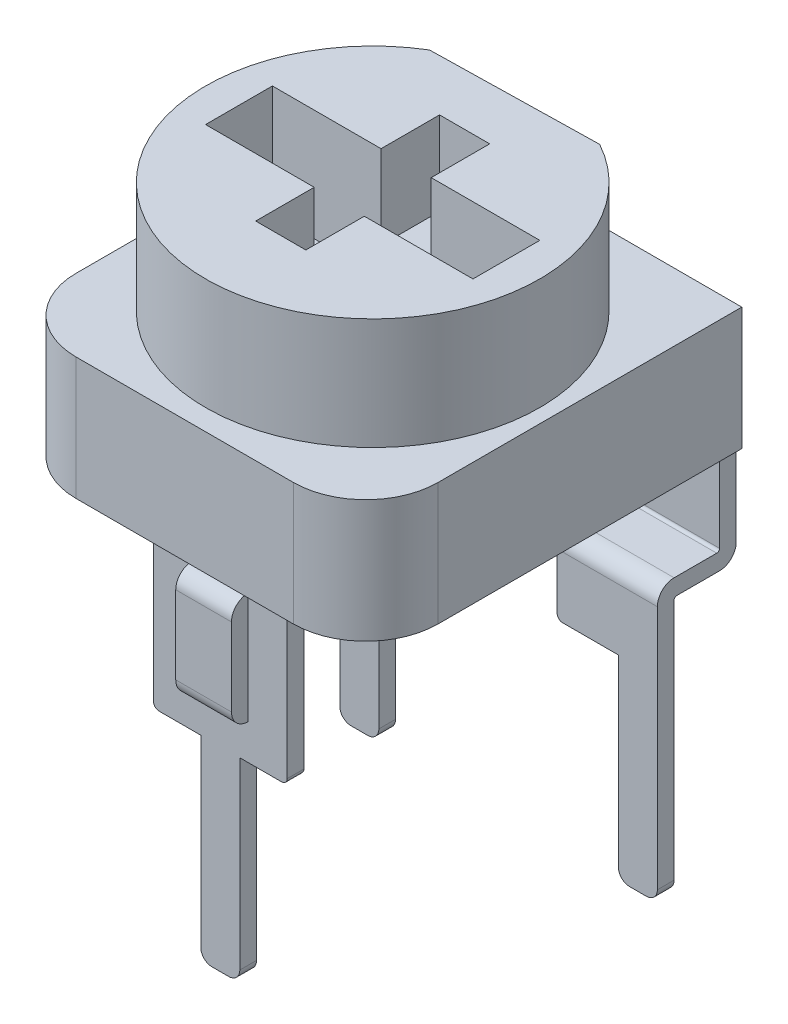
ISO-10303-21;
HEADER;
FILE_DESCRIPTION(('STEP AP214'),'2;1');
FILE_NAME('part.step','',(''),(''),'','','');
FILE_SCHEMA(('AUTOMOTIVE_DESIGN { 1 0 10303 214 1 1 1 1 }'));
ENDSEC;
DATA;
#1=APPLICATION_CONTEXT('core data for automotive mechanical design processes');
#2=APPLICATION_PROTOCOL_DEFINITION('international standard','automotive_design',2000,#1);
#3=PRODUCT_CONTEXT('',#1,'mechanical');
#4=PRODUCT('Part','Part','',(#3));
#5=PRODUCT_RELATED_PRODUCT_CATEGORY('part','',(#4));
#6=PRODUCT_DEFINITION_FORMATION('','',#4);
#7=PRODUCT_DEFINITION_CONTEXT('part definition',#1,'design');
#8=PRODUCT_DEFINITION('design','',#6,#7);
#9=PRODUCT_DEFINITION_SHAPE('','',#8);
#10=(LENGTH_UNIT() NAMED_UNIT(*) SI_UNIT(.MILLI.,.METRE.));
#11=(NAMED_UNIT(*) PLANE_ANGLE_UNIT() SI_UNIT($,.RADIAN.));
#12=(NAMED_UNIT(*) SI_UNIT($,.STERADIAN.) SOLID_ANGLE_UNIT());
#13=UNCERTAINTY_MEASURE_WITH_UNIT(LENGTH_MEASURE(1.E-05),#10,'distance_accuracy_value','');
#14=(GEOMETRIC_REPRESENTATION_CONTEXT(3) GLOBAL_UNCERTAINTY_ASSIGNED_CONTEXT((#13)) GLOBAL_UNIT_ASSIGNED_CONTEXT((#10,
#11,#12)) REPRESENTATION_CONTEXT('',''));
#15=CARTESIAN_POINT('',(0.,0.,0.));
#16=DIRECTION('',(0.,0.,1.));
#17=DIRECTION('',(1.,0.,0.));
#18=AXIS2_PLACEMENT_3D('',#15,#16,#17);
#19=CARTESIAN_POINT('',(-1.05,-5.4,-2.26));
#20=DIRECTION('',(0.,1.,0.));
#21=DIRECTION('',(0.,0.,1.));
#22=AXIS2_PLACEMENT_3D('',#19,#20,#21);
#23=PLANE('',#22);
#24=DIRECTION('',(1.,0.,0.));
#25=VECTOR('',#24,1.);
#26=CARTESIAN_POINT('',(-1.05,-5.4,-2.56));
#27=LINE('',#26,#25);
#28=CARTESIAN_POINT('',(-2.15,-5.4,-2.56));
#29=VERTEX_POINT('',#28);
#30=CARTESIAN_POINT('',(-1.15,-5.4,-2.56));
#31=VERTEX_POINT('',#30);
#32=EDGE_CURVE('E506',#29,#31,#27,.T.);
#33=ORIENTED_EDGE('',*,*,#32,.T.);
#34=DIRECTION('',(0.,0.,1.));
#35=VECTOR('',#34,1.);
#36=CARTESIAN_POINT('',(-1.15,-5.4,-2.26));
#37=LINE('',#36,#35);
#38=CARTESIAN_POINT('',(-1.15,-5.4,-2.26));
#39=VERTEX_POINT('',#38);
#40=EDGE_CURVE('E505',#31,#39,#37,.T.);
#41=ORIENTED_EDGE('',*,*,#40,.T.);
#42=DIRECTION('',(-1.,0.,0.));
#43=VECTOR('',#42,1.);
#44=CARTESIAN_POINT('',(-1.05,-5.4,-2.26));
#45=LINE('',#44,#43);
#46=CARTESIAN_POINT('',(-2.15,-5.4,-2.26));
#47=VERTEX_POINT('',#46);
#48=EDGE_CURVE('E498',#39,#47,#45,.T.);
#49=ORIENTED_EDGE('',*,*,#48,.T.);
#50=DIRECTION('',(0.,0.,1.));
#51=VECTOR('',#50,1.);
#52=CARTESIAN_POINT('',(-2.15,-5.4,-2.26));
#53=LINE('',#52,#51);
#54=EDGE_CURVE('E502',#29,#47,#53,.T.);
#55=ORIENTED_EDGE('',*,*,#54,.F.);
#56=EDGE_LOOP('',(#33,#41,#49,#55));
#57=FACE_BOUND('',#56,.T.);
#58=ADVANCED_FACE('F27',(#57),#23,.F.);
#59=CARTESIAN_POINT('',(2.85,-5.4,-2.56));
#60=DIRECTION('',(0.,1.,0.));
#61=DIRECTION('',(0.,0.,1.));
#62=AXIS2_PLACEMENT_3D('',#59,#60,#61);
#63=PLANE('',#62);
#64=DIRECTION('',(-1.,0.,0.));
#65=VECTOR('',#64,1.);
#66=CARTESIAN_POINT('',(2.85,-5.4,-2.26));
#67=LINE('',#66,#65);
#68=CARTESIAN_POINT('',(2.15,-5.4,-2.26));
#69=VERTEX_POINT('',#68);
#70=CARTESIAN_POINT('',(1.15,-5.4,-2.26));
#71=VERTEX_POINT('',#70);
#72=EDGE_CURVE('E545',#69,#71,#67,.T.);
#73=ORIENTED_EDGE('',*,*,#72,.T.);
#74=DIRECTION('',(0.,0.,-1.));
#75=VECTOR('',#74,1.);
#76=CARTESIAN_POINT('',(1.15,-5.4,-2.56));
#77=LINE('',#76,#75);
#78=CARTESIAN_POINT('',(1.15,-5.4,-2.56));
#79=VERTEX_POINT('',#78);
#80=EDGE_CURVE('E636',#71,#79,#77,.T.);
#81=ORIENTED_EDGE('',*,*,#80,.T.);
#82=DIRECTION('',(1.,0.,0.));
#83=VECTOR('',#82,1.);
#84=CARTESIAN_POINT('',(2.85,-5.4,-2.56));
#85=LINE('',#84,#83);
#86=CARTESIAN_POINT('',(2.15,-5.4,-2.56));
#87=VERTEX_POINT('',#86);
#88=EDGE_CURVE('E607',#79,#87,#85,.T.);
#89=ORIENTED_EDGE('',*,*,#88,.T.);
#90=DIRECTION('',(0.,0.,-1.));
#91=VECTOR('',#90,1.);
#92=CARTESIAN_POINT('',(2.15,-5.4,-2.26));
#93=LINE('',#92,#91);
#94=EDGE_CURVE('E541',#69,#87,#93,.T.);
#95=ORIENTED_EDGE('',*,*,#94,.F.);
#96=EDGE_LOOP('',(#73,#81,#89,#95));
#97=FACE_BOUND('',#96,.T.);
#98=ADVANCED_FACE('F1302',(#97),#63,.F.);
#99=CARTESIAN_POINT('',(-2.85,-4.3,-2.26));
#100=DIRECTION('',(0.,1.,0.));
#101=DIRECTION('',(0.,0.,1.));
#102=AXIS2_PLACEMENT_3D('',#99,#100,#101);
#103=PLANE('',#102);
#104=DIRECTION('',(0.,0.,1.));
#105=VECTOR('',#104,1.);
#106=CARTESIAN_POINT('',(-1.05,-4.3,-3.675));
#107=LINE('',#106,#105);
#108=CARTESIAN_POINT('',(-1.05,-4.3,-3.375));
#109=VERTEX_POINT('',#108);
#110=CARTESIAN_POINT('',(-1.05,-4.3,-2.61));
#111=VERTEX_POINT('',#110);
#112=EDGE_CURVE('E1158',#109,#111,#107,.T.);
#113=ORIENTED_EDGE('',*,*,#112,.T.);
#114=DIRECTION('',(1.,0.,0.));
#115=VECTOR('',#114,1.);
#116=CARTESIAN_POINT('',(-2.85,-4.3,-2.61));
#117=LINE('',#116,#115);
#118=CARTESIAN_POINT('',(-2.85,-4.3,-2.61));
#119=VERTEX_POINT('',#118);
#120=EDGE_CURVE('E1190',#111,#119,#117,.F.);
#121=ORIENTED_EDGE('',*,*,#120,.T.);
#122=DIRECTION('',(0.,0.,-1.));
#123=VECTOR('',#122,1.);
#124=CARTESIAN_POINT('',(-2.85,-4.3,-3.675));
#125=LINE('',#124,#123);
#126=CARTESIAN_POINT('',(-2.85,-4.3,-3.375));
#127=VERTEX_POINT('',#126);
#128=EDGE_CURVE('E1135',#119,#127,#125,.T.);
#129=ORIENTED_EDGE('',*,*,#128,.T.);
#130=DIRECTION('',(1.,0.,0.));
#131=VECTOR('',#130,1.);
#132=CARTESIAN_POINT('',(-1.05,-4.3,-3.375));
#133=LINE('',#132,#131);
#134=EDGE_CURVE('E1107',#127,#109,#133,.T.);
#135=ORIENTED_EDGE('',*,*,#134,.T.);
#136=EDGE_LOOP('',(#113,#121,#129,#135));
#137=FACE_BOUND('',#136,.T.);
#138=ADVANCED_FACE('F1157',(#137),#103,.F.);
#139=CARTESIAN_POINT('',(1.05,-4.3,-2.26));
#140=DIRECTION('',(0.,1.,0.));
#141=DIRECTION('',(0.,0.,1.));
#142=AXIS2_PLACEMENT_3D('',#139,#140,#141);
#143=PLANE('',#142);
#144=DIRECTION('',(0.,0.,1.));
#145=VECTOR('',#144,1.);
#146=CARTESIAN_POINT('',(2.85,-4.3,-3.675));
#147=LINE('',#146,#145);
#148=CARTESIAN_POINT('',(2.85,-4.3,-3.375));
#149=VERTEX_POINT('',#148);
#150=CARTESIAN_POINT('',(2.85,-4.3,-2.61));
#151=VERTEX_POINT('',#150);
#152=EDGE_CURVE('E1233',#149,#151,#147,.T.);
#153=ORIENTED_EDGE('',*,*,#152,.T.);
#154=DIRECTION('',(1.,0.,0.));
#155=VECTOR('',#154,1.);
#156=CARTESIAN_POINT('',(1.05,-4.3,-2.61));
#157=LINE('',#156,#155);
#158=CARTESIAN_POINT('',(1.05,-4.3,-2.61));
#159=VERTEX_POINT('',#158);
#160=EDGE_CURVE('E1195',#151,#159,#157,.F.);
#161=ORIENTED_EDGE('',*,*,#160,.T.);
#162=DIRECTION('',(0.,0.,-1.));
#163=VECTOR('',#162,1.);
#164=CARTESIAN_POINT('',(1.05,-4.3,-3.675));
#165=LINE('',#164,#163);
#166=CARTESIAN_POINT('',(1.05,-4.3,-3.375));
#167=VERTEX_POINT('',#166);
#168=EDGE_CURVE('E684',#159,#167,#165,.T.);
#169=ORIENTED_EDGE('',*,*,#168,.T.);
#170=DIRECTION('',(1.,0.,0.));
#171=VECTOR('',#170,1.);
#172=CARTESIAN_POINT('',(2.85,-4.3,-3.375));
#173=LINE('',#172,#171);
#174=EDGE_CURVE('E1142',#167,#149,#173,.T.);
#175=ORIENTED_EDGE('',*,*,#174,.T.);
#176=EDGE_LOOP('',(#153,#161,#169,#175));
#177=FACE_BOUND('',#176,.T.);
#178=ADVANCED_FACE('F1240',(#177),#143,.F.);
#179=CARTESIAN_POINT('',(3.25,-2.2,-3.375));
#180=DIRECTION('',(0.,0.,1.));
#181=DIRECTION('',(1.,0.,0.));
#182=AXIS2_PLACEMENT_3D('',#179,#180,#181);
#183=PLANE('',#182);
#184=DIRECTION('',(0.,-1.,0.));
#185=VECTOR('',#184,1.);
#186=CARTESIAN_POINT('',(-1.05,-1.,-3.375));
#187=LINE('',#186,#185);
#188=CARTESIAN_POINT('',(-1.05,-1.,-3.375));
#189=VERTEX_POINT('',#188);
#190=CARTESIAN_POINT('',(-1.05,-2.2,-3.375));
#191=VERTEX_POINT('',#190);
#192=EDGE_CURVE('E1116',#189,#191,#187,.T.);
#193=ORIENTED_EDGE('',*,*,#192,.F.);
#194=DIRECTION('',(1.,0.,0.));
#195=VECTOR('',#194,1.);
#196=CARTESIAN_POINT('',(-2.85,-1.,-3.375));
#197=LINE('',#196,#195);
#198=CARTESIAN_POINT('',(-2.85,-1.,-3.375));
#199=VERTEX_POINT('',#198);
#200=EDGE_CURVE('E1117',#199,#189,#197,.T.);
#201=ORIENTED_EDGE('',*,*,#200,.F.);
#202=DIRECTION('',(0.,1.,0.));
#203=VECTOR('',#202,1.);
#204=CARTESIAN_POINT('',(-2.85,-1.,-3.375));
#205=LINE('',#204,#203);
#206=CARTESIAN_POINT('',(-2.85,-2.2,-3.375));
#207=VERTEX_POINT('',#206);
#208=EDGE_CURVE('E1122',#207,#199,#205,.T.);
#209=ORIENTED_EDGE('',*,*,#208,.F.);
#210=DIRECTION('',(1.,0.,0.));
#211=VECTOR('',#210,1.);
#212=CARTESIAN_POINT('',(3.25,-2.2,-3.375));
#213=LINE('',#212,#211);
#214=CARTESIAN_POINT('',(-3.25,-2.2,-3.375));
#215=VERTEX_POINT('',#214);
#216=EDGE_CURVE('E971',#215,#207,#213,.T.);
#217=ORIENTED_EDGE('',*,*,#216,.F.);
#218=DIRECTION('',(0.,1.,0.));
#219=VECTOR('',#218,1.);
#220=CARTESIAN_POINT('',(-3.25,-2.2,-3.375));
#221=LINE('',#220,#219);
#222=CARTESIAN_POINT('',(-3.25,0.,-3.375));
#223=VERTEX_POINT('',#222);
#224=EDGE_CURVE('E945',#215,#223,#221,.T.);
#225=ORIENTED_EDGE('',*,*,#224,.T.);
#226=DIRECTION('',(1.,0.,0.));
#227=VECTOR('',#226,1.);
#228=CARTESIAN_POINT('',(3.25,0.,-3.375));
#229=LINE('',#228,#227);
#230=CARTESIAN_POINT('',(3.25,0.,-3.375));
#231=VERTEX_POINT('',#230);
#232=EDGE_CURVE('E989',#223,#231,#229,.T.);
#233=ORIENTED_EDGE('',*,*,#232,.T.);
#234=DIRECTION('',(0.,1.,0.));
#235=VECTOR('',#234,1.);
#236=CARTESIAN_POINT('',(3.25,-2.2,-3.375));
#237=LINE('',#236,#235);
#238=CARTESIAN_POINT('',(3.25,-2.2,-3.375));
#239=VERTEX_POINT('',#238);
#240=EDGE_CURVE('E948',#239,#231,#237,.T.);
#241=ORIENTED_EDGE('',*,*,#240,.F.);
#242=CARTESIAN_POINT('',(2.85,-2.2,-3.375));
#243=VERTEX_POINT('',#242);
#244=EDGE_CURVE('E980',#243,#239,#213,.T.);
#245=ORIENTED_EDGE('',*,*,#244,.F.);
#246=DIRECTION('',(0.,-1.,0.));
#247=VECTOR('',#246,1.);
#248=CARTESIAN_POINT('',(2.85,-1.,-3.375));
#249=LINE('',#248,#247);
#250=CARTESIAN_POINT('',(2.85,-1.,-3.375));
#251=VERTEX_POINT('',#250);
#252=EDGE_CURVE('E700',#251,#243,#249,.T.);
#253=ORIENTED_EDGE('',*,*,#252,.F.);
#254=DIRECTION('',(1.,0.,0.));
#255=VECTOR('',#254,1.);
#256=CARTESIAN_POINT('',(2.85,-1.,-3.375));
#257=LINE('',#256,#255);
#258=CARTESIAN_POINT('',(1.05,-1.,-3.375));
#259=VERTEX_POINT('',#258);
#260=EDGE_CURVE('E699',#259,#251,#257,.T.);
#261=ORIENTED_EDGE('',*,*,#260,.F.);
#262=DIRECTION('',(0.,1.,0.));
#263=VECTOR('',#262,1.);
#264=CARTESIAN_POINT('',(1.05,-1.,-3.375));
#265=LINE('',#264,#263);
#266=CARTESIAN_POINT('',(1.05,-2.2,-3.375));
#267=VERTEX_POINT('',#266);
#268=EDGE_CURVE('E702',#267,#259,#265,.T.);
#269=ORIENTED_EDGE('',*,*,#268,.F.);
#270=EDGE_CURVE('E975',#191,#267,#213,.T.);
#271=ORIENTED_EDGE('',*,*,#270,.F.);
#272=EDGE_LOOP('',(#193,#201,#209,#217,#225,#233,#241,#245,#253,#261,#269,#271));
#273=FACE_BOUND('',#272,.T.);
#274=ADVANCED_FACE('F1257',(#273),#183,.F.);
#275=CARTESIAN_POINT('',(1.2,-5.4,2.735));
#276=DIRECTION('',(0.,0.,-1.));
#277=DIRECTION('',(-1.,0.,0.));
#278=AXIS2_PLACEMENT_3D('',#275,#276,#277);
#279=PLANE('',#278);
#280=DIRECTION('',(-1.,0.,0.));
#281=VECTOR('',#280,1.);
#282=CARTESIAN_POINT('',(0.35,-8.9,2.735));
#283=LINE('',#282,#281);
#284=CARTESIAN_POINT('',(0.15,-8.9,2.735));
#285=VERTEX_POINT('',#284);
#286=CARTESIAN_POINT('',(-0.15,-8.9,2.735));
#287=VERTEX_POINT('',#286);
#288=EDGE_CURVE('E1024',#285,#287,#283,.T.);
#289=ORIENTED_EDGE('',*,*,#288,.F.);
#290=CARTESIAN_POINT('',(0.15,-8.7,2.735));
#291=DIRECTION('',(0.,0.,-1.));
#292=DIRECTION('',(-1.,0.,0.));
#293=AXIS2_PLACEMENT_3D('',#290,#291,#292);
#294=CIRCLE('',#293,0.2);
#295=CARTESIAN_POINT('',(0.35,-8.7,2.735));
#296=VERTEX_POINT('',#295);
#297=EDGE_CURVE('E775',#285,#296,#294,.F.);
#298=ORIENTED_EDGE('',*,*,#297,.T.);
#299=DIRECTION('',(0.,1.,0.));
#300=VECTOR('',#299,1.);
#301=CARTESIAN_POINT('',(0.35,-8.9,2.735));
#302=LINE('',#301,#300);
#303=CARTESIAN_POINT('',(0.35,-5.4,2.735));
#304=VERTEX_POINT('',#303);
#305=EDGE_CURVE('E791',#296,#304,#302,.T.);
#306=ORIENTED_EDGE('',*,*,#305,.T.);
#307=DIRECTION('',(-1.,0.,0.));
#308=VECTOR('',#307,1.);
#309=CARTESIAN_POINT('',(1.2,-5.4,2.735));
#310=LINE('',#309,#308);
#311=CARTESIAN_POINT('',(1.1,-5.4,2.735));
#312=VERTEX_POINT('',#311);
#313=EDGE_CURVE('E766',#312,#304,#310,.T.);
#314=ORIENTED_EDGE('',*,*,#313,.F.);
#315=CARTESIAN_POINT('',(1.1,-5.3,2.735));
#316=DIRECTION('',(0.,0.,-1.));
#317=DIRECTION('',(-1.,0.,0.));
#318=AXIS2_PLACEMENT_3D('',#315,#316,#317);
#319=CIRCLE('',#318,0.1);
#320=CARTESIAN_POINT('',(1.2,-5.3,2.735));
#321=VERTEX_POINT('',#320);
#322=EDGE_CURVE('E1043',#312,#321,#319,.F.);
#323=ORIENTED_EDGE('',*,*,#322,.T.);
#324=DIRECTION('',(0.,1.,0.));
#325=VECTOR('',#324,1.);
#326=CARTESIAN_POINT('',(1.2,-5.4,2.735));
#327=LINE('',#326,#325);
#328=CARTESIAN_POINT('',(1.2,-2.2,2.735));
#329=VERTEX_POINT('',#328);
#330=EDGE_CURVE('E994',#321,#329,#327,.T.);
#331=ORIENTED_EDGE('',*,*,#330,.T.);
#332=DIRECTION('',(-1.,0.,0.));
#333=VECTOR('',#332,1.);
#334=CARTESIAN_POINT('',(1.2,-2.2,2.735));
#335=LINE('',#334,#333);
#336=CARTESIAN_POINT('',(-1.2,-2.2,2.735));
#337=VERTEX_POINT('',#336);
#338=EDGE_CURVE('E1016',#329,#337,#335,.T.);
#339=ORIENTED_EDGE('',*,*,#338,.T.);
#340=DIRECTION('',(0.,1.,0.));
#341=VECTOR('',#340,1.);
#342=CARTESIAN_POINT('',(-1.2,-5.4,2.735));
#343=LINE('',#342,#341);
#344=CARTESIAN_POINT('',(-1.2,-5.3,2.735));
#345=VERTEX_POINT('',#344);
#346=EDGE_CURVE('E996',#345,#337,#343,.T.);
#347=ORIENTED_EDGE('',*,*,#346,.F.);
#348=CARTESIAN_POINT('',(-1.1,-5.3,2.735));
#349=DIRECTION('',(0.,0.,-1.));
#350=DIRECTION('',(-1.,0.,0.));
#351=AXIS2_PLACEMENT_3D('',#348,#349,#350);
#352=CIRCLE('',#351,0.1);
#353=CARTESIAN_POINT('',(-1.1,-5.4,2.735));
#354=VERTEX_POINT('',#353);
#355=EDGE_CURVE('E1040',#345,#354,#352,.F.);
#356=ORIENTED_EDGE('',*,*,#355,.T.);
#357=CARTESIAN_POINT('',(-0.35,-5.4,2.735));
#358=VERTEX_POINT('',#357);
#359=EDGE_CURVE('E835',#358,#354,#310,.T.);
#360=ORIENTED_EDGE('',*,*,#359,.F.);
#361=DIRECTION('',(0.,1.,0.));
#362=VECTOR('',#361,1.);
#363=CARTESIAN_POINT('',(-0.35,-8.9,2.735));
#364=LINE('',#363,#362);
#365=CARTESIAN_POINT('',(-0.35,-8.7,2.735));
#366=VERTEX_POINT('',#365);
#367=EDGE_CURVE('E782',#366,#358,#364,.T.);
#368=ORIENTED_EDGE('',*,*,#367,.F.);
#369=CARTESIAN_POINT('',(-0.15,-8.7,2.735));
#370=DIRECTION('',(0.,0.,-1.));
#371=DIRECTION('',(-1.,0.,0.));
#372=AXIS2_PLACEMENT_3D('',#369,#370,#371);
#373=CIRCLE('',#372,0.2);
#374=EDGE_CURVE('E795',#366,#287,#373,.F.);
#375=ORIENTED_EDGE('',*,*,#374,.T.);
#376=EDGE_LOOP('',(#289,#298,#306,#314,#323,#331,#339,#347,#356,#360,#368,#375));
#377=FACE_BOUND('',#376,.T.);
#378=DIRECTION('',(0.,-1.,0.));
#379=VECTOR('',#378,1.);
#380=CARTESIAN_POINT('',(-0.5,-2.76399133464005,2.735));
#381=LINE('',#380,#379);
#382=CARTESIAN_POINT('',(-0.5,-2.76399133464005,2.735));
#383=VERTEX_POINT('',#382);
#384=CARTESIAN_POINT('',(-0.5,-4.76399133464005,2.735));
#385=VERTEX_POINT('',#384);
#386=EDGE_CURVE('E734',#383,#385,#381,.T.);
#387=ORIENTED_EDGE('',*,*,#386,.F.);
#388=DIRECTION('',(-1.,0.,0.));
#389=VECTOR('',#388,1.);
#390=CARTESIAN_POINT('',(-0.5,-2.76399133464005,2.735));
#391=LINE('',#390,#389);
#392=CARTESIAN_POINT('',(0.499999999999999,-2.76399133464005,2.735));
#393=VERTEX_POINT('',#392);
#394=EDGE_CURVE('E743',#393,#383,#391,.T.);
#395=ORIENTED_EDGE('',*,*,#394,.F.);
#396=DIRECTION('',(0.,1.,0.));
#397=VECTOR('',#396,1.);
#398=CARTESIAN_POINT('',(0.499999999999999,-2.76399133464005,2.735));
#399=LINE('',#398,#397);
#400=CARTESIAN_POINT('',(0.5,-4.76399133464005,2.735));
#401=VERTEX_POINT('',#400);
#402=EDGE_CURVE('E740',#401,#393,#399,.T.);
#403=ORIENTED_EDGE('',*,*,#402,.F.);
#404=DIRECTION('',(1.,0.,0.));
#405=VECTOR('',#404,1.);
#406=CARTESIAN_POINT('',(-0.5,-4.76399133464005,2.735));
#407=LINE('',#406,#405);
#408=EDGE_CURVE('E737',#385,#401,#407,.T.);
#409=ORIENTED_EDGE('',*,*,#408,.F.);
#410=EDGE_LOOP('',(#387,#395,#403,#409));
#411=FACE_BOUND('',#410,.T.);
#412=ADVANCED_FACE('F1036',(#377,#411),#279,.F.);
#413=CARTESIAN_POINT('',(1.2,-5.4,2.435));
#414=DIRECTION('',(0.,1.,0.));
#415=DIRECTION('',(0.,0.,1.));
#416=AXIS2_PLACEMENT_3D('',#413,#414,#415);
#417=PLANE('',#416);
#418=DIRECTION('',(1.,0.,0.));
#419=VECTOR('',#418,1.);
#420=CARTESIAN_POINT('',(1.2,-5.4,2.435));
#421=LINE('',#420,#419);
#422=CARTESIAN_POINT('',(0.35,-5.4,2.435));
#423=VERTEX_POINT('',#422);
#424=CARTESIAN_POINT('',(1.1,-5.4,2.435));
#425=VERTEX_POINT('',#424);
#426=EDGE_CURVE('E825',#423,#425,#421,.T.);
#427=ORIENTED_EDGE('',*,*,#426,.T.);
#428=DIRECTION('',(0.,0.,1.));
#429=VECTOR('',#428,1.);
#430=CARTESIAN_POINT('',(1.1,-5.4,2.435));
#431=LINE('',#430,#429);
#432=EDGE_CURVE('E842',#425,#312,#431,.T.);
#433=ORIENTED_EDGE('',*,*,#432,.T.);
#434=ORIENTED_EDGE('',*,*,#313,.T.);
#435=DIRECTION('',(0.,0.,1.));
#436=VECTOR('',#435,1.);
#437=CARTESIAN_POINT('',(0.35,-5.4,2.735));
#438=LINE('',#437,#436);
#439=EDGE_CURVE('E752',#423,#304,#438,.T.);
#440=ORIENTED_EDGE('',*,*,#439,.F.);
#441=EDGE_LOOP('',(#427,#433,#434,#440));
#442=FACE_BOUND('',#441,.T.);
#443=ADVANCED_FACE('F1050',(#442),#417,.F.);
#444=ORIENTED_EDGE('',*,*,#359,.T.);
#445=DIRECTION('',(0.,0.,-1.));
#446=VECTOR('',#445,1.);
#447=CARTESIAN_POINT('',(-1.1,-5.4,2.43499999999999));
#448=LINE('',#447,#446);
#449=CARTESIAN_POINT('',(-1.1,-5.4,2.435));
#450=VERTEX_POINT('',#449);
#451=EDGE_CURVE('E810',#354,#450,#448,.T.);
#452=ORIENTED_EDGE('',*,*,#451,.T.);
#453=CARTESIAN_POINT('',(-0.35,-5.4,2.435));
#454=VERTEX_POINT('',#453);
#455=EDGE_CURVE('E820',#450,#454,#421,.T.);
#456=ORIENTED_EDGE('',*,*,#455,.T.);
#457=DIRECTION('',(0.,0.,-1.));
#458=VECTOR('',#457,1.);
#459=CARTESIAN_POINT('',(-0.35,-5.4,2.735));
#460=LINE('',#459,#458);
#461=EDGE_CURVE('E761',#358,#454,#460,.T.);
#462=ORIENTED_EDGE('',*,*,#461,.F.);
#463=EDGE_LOOP('',(#444,#452,#456,#462));
#464=FACE_BOUND('',#463,.T.);
#465=ADVANCED_FACE('F1033',(#464),#417,.F.);
#466=CARTESIAN_POINT('',(1.95,-2.2,2.075));
#467=DIRECTION('',(0.,1.,0.));
#468=DIRECTION('',(0.,0.,1.));
#469=AXIS2_PLACEMENT_3D('',#466,#467,#468);
#470=PLANE('',#469);
#471=DIRECTION('',(0.,0.,-1.));
#472=VECTOR('',#471,1.);
#473=CARTESIAN_POINT('',(-3.25,-2.2,2.07499999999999));
#474=LINE('',#473,#472);
#475=CARTESIAN_POINT('',(-3.25,-2.2,2.07499999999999));
#476=VERTEX_POINT('',#475);
#477=EDGE_CURVE('E977',#476,#215,#474,.T.);
#478=ORIENTED_EDGE('',*,*,#477,.T.);
#479=ORIENTED_EDGE('',*,*,#216,.T.);
#480=EDGE_CURVE('E974',#207,#191,#213,.T.);
#481=ORIENTED_EDGE('',*,*,#480,.T.);
#482=ORIENTED_EDGE('',*,*,#270,.T.);
#483=EDGE_CURVE('E976',#267,#243,#213,.T.);
#484=ORIENTED_EDGE('',*,*,#483,.T.);
#485=ORIENTED_EDGE('',*,*,#244,.T.);
#486=DIRECTION('',(0.,0.,1.));
#487=VECTOR('',#486,1.);
#488=CARTESIAN_POINT('',(3.25,-2.2,2.07499999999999));
#489=LINE('',#488,#487);
#490=CARTESIAN_POINT('',(3.25,-2.2,2.07499999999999));
#491=VERTEX_POINT('',#490);
#492=EDGE_CURVE('E969',#239,#491,#489,.T.);
#493=ORIENTED_EDGE('',*,*,#492,.T.);
#494=CARTESIAN_POINT('',(1.95,-2.2,2.075));
#495=DIRECTION('',(0.,-1.,0.));
#496=DIRECTION('',(0.,0.,1.));
#497=AXIS2_PLACEMENT_3D('',#494,#495,#496);
#498=CIRCLE('',#497,1.3);
#499=CARTESIAN_POINT('',(1.94999999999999,-2.2,3.375));
#500=VERTEX_POINT('',#499);
#501=EDGE_CURVE('E967',#491,#500,#498,.T.);
#502=ORIENTED_EDGE('',*,*,#501,.T.);
#503=DIRECTION('',(-1.,0.,0.));
#504=VECTOR('',#503,1.);
#505=CARTESIAN_POINT('',(1.94999999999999,-2.2,3.375));
#506=LINE('',#505,#504);
#507=CARTESIAN_POINT('',(-1.94999999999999,-2.2,3.375));
#508=VERTEX_POINT('',#507);
#509=EDGE_CURVE('E965',#500,#508,#506,.T.);
#510=ORIENTED_EDGE('',*,*,#509,.T.);
#511=CARTESIAN_POINT('',(-1.95,-2.2,2.075));
#512=DIRECTION('',(0.,-1.,0.));
#513=DIRECTION('',(0.,0.,1.));
#514=AXIS2_PLACEMENT_3D('',#511,#512,#513);
#515=CIRCLE('',#514,1.3);
#516=EDGE_CURVE('E963',#508,#476,#515,.T.);
#517=ORIENTED_EDGE('',*,*,#516,.T.);
#518=EDGE_LOOP('',(#478,#479,#481,#482,#484,#485,#493,#502,#510,#517));
#519=FACE_BOUND('',#518,.T.);
#520=DIRECTION('',(0.,0.,1.));
#521=VECTOR('',#520,1.);
#522=CARTESIAN_POINT('',(1.2,-2.2,2.735));
#523=LINE('',#522,#521);
#524=CARTESIAN_POINT('',(1.2,-2.2,2.435));
#525=VERTEX_POINT('',#524);
#526=EDGE_CURVE('E794',#525,#329,#523,.T.);
#527=ORIENTED_EDGE('',*,*,#526,.F.);
#528=DIRECTION('',(1.,0.,0.));
#529=VECTOR('',#528,1.);
#530=CARTESIAN_POINT('',(1.2,-2.2,2.435));
#531=LINE('',#530,#529);
#532=CARTESIAN_POINT('',(-1.2,-2.2,2.435));
#533=VERTEX_POINT('',#532);
#534=EDGE_CURVE('E838',#533,#525,#531,.T.);
#535=ORIENTED_EDGE('',*,*,#534,.F.);
#536=DIRECTION('',(0.,0.,-1.));
#537=VECTOR('',#536,1.);
#538=CARTESIAN_POINT('',(-1.2,-2.2,2.735));
#539=LINE('',#538,#537);
#540=EDGE_CURVE('E1020',#337,#533,#539,.T.);
#541=ORIENTED_EDGE('',*,*,#540,.F.);
#542=ORIENTED_EDGE('',*,*,#338,.F.);
#543=EDGE_LOOP('',(#527,#535,#541,#542));
#544=FACE_BOUND('',#543,.T.);
#545=ADVANCED_FACE('F1012',(#519,#544),#470,.F.);
#546=CARTESIAN_POINT('',(0.,2.,0.));
#547=DIRECTION('',(0.,-1.,0.));
#548=DIRECTION('',(0.,0.,-1.));
#549=AXIS2_PLACEMENT_3D('',#546,#547,#548);
#550=CYLINDRICAL_SURFACE('',#549,3.);
#551=CARTESIAN_POINT('',(0.,0.,0.));
#552=DIRECTION('',(0.,1.,0.));
#553=DIRECTION('',(0.,0.,1.));
#554=AXIS2_PLACEMENT_3D('',#551,#552,#553);
#555=CIRCLE('',#554,3.);
#556=CARTESIAN_POINT('',(-1.54885590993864,0.,-2.569249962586));
#557=VERTEX_POINT('',#556);
#558=CARTESIAN_POINT('',(1.44385974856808,0.,-2.62968991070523));
#559=VERTEX_POINT('',#558);
#560=EDGE_CURVE('E863',#557,#559,#555,.T.);
#561=ORIENTED_EDGE('',*,*,#560,.T.);
#562=DIRECTION('',(0.,-1.,0.));
#563=VECTOR('',#562,1.);
#564=CARTESIAN_POINT('',(1.44385974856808,2.,-2.62968991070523));
#565=LINE('',#564,#563);
#566=CARTESIAN_POINT('',(1.44385974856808,2.,-2.62968991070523));
#567=VERTEX_POINT('',#566);
#568=EDGE_CURVE('E849',#567,#559,#565,.T.);
#569=ORIENTED_EDGE('',*,*,#568,.F.);
#570=CARTESIAN_POINT('',(0.,2.,0.));
#571=DIRECTION('',(0.,1.,0.));
#572=DIRECTION('',(0.,0.,1.));
#573=AXIS2_PLACEMENT_3D('',#570,#571,#572);
#574=CIRCLE('',#573,3.);
#575=CARTESIAN_POINT('',(-1.54885590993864,2.,-2.569249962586));
#576=VERTEX_POINT('',#575);
#577=EDGE_CURVE('E857',#576,#567,#574,.T.);
#578=ORIENTED_EDGE('',*,*,#577,.F.);
#579=DIRECTION('',(0.,-1.,0.));
#580=VECTOR('',#579,1.);
#581=CARTESIAN_POINT('',(-1.54885590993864,2.,-2.569249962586));
#582=LINE('',#581,#580);
#583=EDGE_CURVE('E852',#576,#557,#582,.T.);
#584=ORIENTED_EDGE('',*,*,#583,.T.);
#585=EDGE_LOOP('',(#561,#569,#578,#584));
#586=FACE_BOUND('',#585,.T.);
#587=ADVANCED_FACE('F29',(#586),#550,.T.);
#588=CARTESIAN_POINT('',(-1.54885590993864,2.,-2.569249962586));
#589=DIRECTION('',(0.0201915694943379,0.,0.999796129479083));
#590=DIRECTION('',(0.999796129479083,0.,-0.0201915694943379));
#591=AXIS2_PLACEMENT_3D('',#588,#589,#590);
#592=PLANE('',#591);
#593=DIRECTION('',(-0.999796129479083,0.,0.0201915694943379));
#594=VECTOR('',#593,1.);
#595=CARTESIAN_POINT('',(-1.54885590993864,0.,-2.569249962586));
#596=LINE('',#595,#594);
#597=EDGE_CURVE('E860',#559,#557,#596,.T.);
#598=ORIENTED_EDGE('',*,*,#597,.T.);
#599=ORIENTED_EDGE('',*,*,#583,.F.);
#600=DIRECTION('',(-0.999796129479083,0.,0.0201915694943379));
#601=VECTOR('',#600,1.);
#602=CARTESIAN_POINT('',(-1.54885590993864,2.,-2.569249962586));
#603=LINE('',#602,#601);
#604=EDGE_CURVE('E855',#567,#576,#603,.T.);
#605=ORIENTED_EDGE('',*,*,#604,.F.);
#606=ORIENTED_EDGE('',*,*,#568,.T.);
#607=EDGE_LOOP('',(#598,#599,#605,#606));
#608=FACE_BOUND('',#607,.T.);
#609=ADVANCED_FACE('F1739',(#608),#592,.F.);
#610=CARTESIAN_POINT('',(0.,2.,0.));
#611=DIRECTION('',(0.,1.,0.));
#612=DIRECTION('',(0.,0.,1.));
#613=AXIS2_PLACEMENT_3D('',#610,#611,#612);
#614=PLANE('',#613);
#615=DIRECTION('',(0.,0.,-1.));
#616=VECTOR('',#615,1.);
#617=CARTESIAN_POINT('',(0.45,2.,-1.65));
#618=LINE('',#617,#616);
#619=CARTESIAN_POINT('',(0.45,2.,1.65));
#620=VERTEX_POINT('',#619);
#621=CARTESIAN_POINT('',(0.45,2.,0.6));
#622=VERTEX_POINT('',#621);
#623=EDGE_CURVE('E942',#620,#622,#618,.T.);
#624=ORIENTED_EDGE('',*,*,#623,.F.);
#625=DIRECTION('',(1.,0.,0.));
#626=VECTOR('',#625,1.);
#627=CARTESIAN_POINT('',(0.45,2.,1.65));
#628=LINE('',#627,#626);
#629=CARTESIAN_POINT('',(-0.45,2.,1.65));
#630=VERTEX_POINT('',#629);
#631=EDGE_CURVE('E933',#630,#620,#628,.T.);
#632=ORIENTED_EDGE('',*,*,#631,.F.);
#633=DIRECTION('',(0.,0.,1.));
#634=VECTOR('',#633,1.);
#635=CARTESIAN_POINT('',(-0.45,2.,-1.65));
#636=LINE('',#635,#634);
#637=CARTESIAN_POINT('',(-0.45,2.,0.6));
#638=VERTEX_POINT('',#637);
#639=EDGE_CURVE('E938',#638,#630,#636,.T.);
#640=ORIENTED_EDGE('',*,*,#639,.F.);
#641=DIRECTION('',(1.,0.,0.));
#642=VECTOR('',#641,1.);
#643=CARTESIAN_POINT('',(2.4,2.,0.6));
#644=LINE('',#643,#642);
#645=CARTESIAN_POINT('',(-2.4,2.,0.6));
#646=VERTEX_POINT('',#645);
#647=EDGE_CURVE('E889',#646,#638,#644,.T.);
#648=ORIENTED_EDGE('',*,*,#647,.F.);
#649=DIRECTION('',(0.,0.,1.));
#650=VECTOR('',#649,1.);
#651=CARTESIAN_POINT('',(-2.4,2.,-0.6));
#652=LINE('',#651,#650);
#653=CARTESIAN_POINT('',(-2.4,2.,-0.6));
#654=VERTEX_POINT('',#653);
#655=EDGE_CURVE('E893',#654,#646,#652,.T.);
#656=ORIENTED_EDGE('',*,*,#655,.F.);
#657=DIRECTION('',(-1.,0.,0.));
#658=VECTOR('',#657,1.);
#659=CARTESIAN_POINT('',(2.4,2.,-0.6));
#660=LINE('',#659,#658);
#661=CARTESIAN_POINT('',(-0.45,2.,-0.600000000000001));
#662=VERTEX_POINT('',#661);
#663=EDGE_CURVE('E899',#662,#654,#660,.T.);
#664=ORIENTED_EDGE('',*,*,#663,.F.);
#665=CARTESIAN_POINT('',(-0.45,2.,-1.65));
#666=VERTEX_POINT('',#665);
#667=EDGE_CURVE('E936',#666,#662,#636,.T.);
#668=ORIENTED_EDGE('',*,*,#667,.F.);
#669=DIRECTION('',(-1.,0.,0.));
#670=VECTOR('',#669,1.);
#671=CARTESIAN_POINT('',(0.45,2.,-1.65));
#672=LINE('',#671,#670);
#673=CARTESIAN_POINT('',(0.45,2.,-1.65));
#674=VERTEX_POINT('',#673);
#675=EDGE_CURVE('E939',#674,#666,#672,.T.);
#676=ORIENTED_EDGE('',*,*,#675,.F.);
#677=CARTESIAN_POINT('',(0.45,2.,-0.600000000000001));
#678=VERTEX_POINT('',#677);
#679=EDGE_CURVE('E944',#678,#674,#618,.T.);
#680=ORIENTED_EDGE('',*,*,#679,.F.);
#681=CARTESIAN_POINT('',(2.4,2.,-0.6));
#682=VERTEX_POINT('',#681);
#683=EDGE_CURVE('E896',#682,#678,#660,.T.);
#684=ORIENTED_EDGE('',*,*,#683,.F.);
#685=DIRECTION('',(0.,0.,-1.));
#686=VECTOR('',#685,1.);
#687=CARTESIAN_POINT('',(2.4,2.,-0.6));
#688=LINE('',#687,#686);
#689=CARTESIAN_POINT('',(2.4,2.,0.6));
#690=VERTEX_POINT('',#689);
#691=EDGE_CURVE('E900',#690,#682,#688,.T.);
#692=ORIENTED_EDGE('',*,*,#691,.F.);
#693=EDGE_CURVE('E892',#622,#690,#644,.T.);
#694=ORIENTED_EDGE('',*,*,#693,.F.);
#695=EDGE_LOOP('',(#624,#632,#640,#648,#656,#664,#668,#676,#680,#684,#692,#694));
#696=FACE_BOUND('',#695,.T.);
#697=ORIENTED_EDGE('',*,*,#577,.T.);
#698=ORIENTED_EDGE('',*,*,#604,.T.);
#699=EDGE_LOOP('',(#697,#698));
#700=FACE_BOUND('',#699,.T.);
#701=ADVANCED_FACE('F1736',(#696,#700),#614,.T.);
#702=CARTESIAN_POINT('',(2.4,0.,-0.6));
#703=DIRECTION('',(1.,0.,0.));
#704=DIRECTION('',(0.,0.,-1.));
#705=AXIS2_PLACEMENT_3D('',#702,#703,#704);
#706=PLANE('',#705);
#707=ORIENTED_EDGE('',*,*,#691,.T.);
#708=DIRECTION('',(0.,1.,0.));
#709=VECTOR('',#708,1.);
#710=CARTESIAN_POINT('',(2.4,0.,-0.6));
#711=LINE('',#710,#709);
#712=CARTESIAN_POINT('',(2.4,0.,-0.6));
#713=VERTEX_POINT('',#712);
#714=EDGE_CURVE('E867',#713,#682,#711,.T.);
#715=ORIENTED_EDGE('',*,*,#714,.F.);
#716=DIRECTION('',(0.,0.,-1.));
#717=VECTOR('',#716,1.);
#718=CARTESIAN_POINT('',(2.4,0.,-0.6));
#719=LINE('',#718,#717);
#720=CARTESIAN_POINT('',(2.4,0.,0.6));
#721=VERTEX_POINT('',#720);
#722=EDGE_CURVE('E886',#721,#713,#719,.T.);
#723=ORIENTED_EDGE('',*,*,#722,.F.);
#724=DIRECTION('',(0.,1.,0.));
#725=VECTOR('',#724,1.);
#726=CARTESIAN_POINT('',(2.4,0.,0.6));
#727=LINE('',#726,#725);
#728=EDGE_CURVE('E866',#721,#690,#727,.T.);
#729=ORIENTED_EDGE('',*,*,#728,.T.);
#730=EDGE_LOOP('',(#707,#715,#723,#729));
#731=FACE_BOUND('',#730,.T.);
#732=ADVANCED_FACE('F1725',(#731),#706,.F.);
#733=CARTESIAN_POINT('',(2.4,0.,0.6));
#734=DIRECTION('',(0.,0.,1.));
#735=DIRECTION('',(1.,0.,0.));
#736=AXIS2_PLACEMENT_3D('',#733,#734,#735);
#737=PLANE('',#736);
#738=DIRECTION('',(1.,0.,0.));
#739=VECTOR('',#738,1.);
#740=CARTESIAN_POINT('',(2.4,0.5,0.6));
#741=LINE('',#740,#739);
#742=CARTESIAN_POINT('',(-0.45,0.5,0.6));
#743=VERTEX_POINT('',#742);
#744=CARTESIAN_POINT('',(0.45,0.5,0.6));
#745=VERTEX_POINT('',#744);
#746=EDGE_CURVE('E908',#743,#745,#741,.T.);
#747=ORIENTED_EDGE('',*,*,#746,.T.);
#748=DIRECTION('',(0.,1.,0.));
#749=VECTOR('',#748,1.);
#750=CARTESIAN_POINT('',(0.45,0.,0.6));
#751=LINE('',#750,#749);
#752=EDGE_CURVE('E902',#745,#622,#751,.T.);
#753=ORIENTED_EDGE('',*,*,#752,.T.);
#754=ORIENTED_EDGE('',*,*,#693,.T.);
#755=ORIENTED_EDGE('',*,*,#728,.F.);
#756=DIRECTION('',(1.,0.,0.));
#757=VECTOR('',#756,1.);
#758=CARTESIAN_POINT('',(2.4,0.,0.6));
#759=LINE('',#758,#757);
#760=CARTESIAN_POINT('',(-2.4,0.,0.6));
#761=VERTEX_POINT('',#760);
#762=EDGE_CURVE('E871',#761,#721,#759,.T.);
#763=ORIENTED_EDGE('',*,*,#762,.F.);
#764=DIRECTION('',(0.,1.,0.));
#765=VECTOR('',#764,1.);
#766=CARTESIAN_POINT('',(-2.4,0.,0.6));
#767=LINE('',#766,#765);
#768=EDGE_CURVE('E874',#761,#646,#767,.T.);
#769=ORIENTED_EDGE('',*,*,#768,.T.);
#770=ORIENTED_EDGE('',*,*,#647,.T.);
#771=DIRECTION('',(0.,-1.,0.));
#772=VECTOR('',#771,1.);
#773=CARTESIAN_POINT('',(-0.45,0.,0.6));
#774=LINE('',#773,#772);
#775=EDGE_CURVE('E905',#638,#743,#774,.T.);
#776=ORIENTED_EDGE('',*,*,#775,.T.);
#777=EDGE_LOOP('',(#747,#753,#754,#755,#763,#769,#770,#776));
#778=FACE_BOUND('',#777,.T.);
#779=ADVANCED_FACE('F1721',(#778),#737,.F.);
#780=CARTESIAN_POINT('',(-2.4,0.,-0.6));
#781=DIRECTION('',(-1.,0.,0.));
#782=DIRECTION('',(0.,0.,1.));
#783=AXIS2_PLACEMENT_3D('',#780,#781,#782);
#784=PLANE('',#783);
#785=ORIENTED_EDGE('',*,*,#655,.T.);
#786=ORIENTED_EDGE('',*,*,#768,.F.);
#787=DIRECTION('',(0.,0.,1.));
#788=VECTOR('',#787,1.);
#789=CARTESIAN_POINT('',(-2.4,0.,-0.6));
#790=LINE('',#789,#788);
#791=CARTESIAN_POINT('',(-2.4,0.,-0.6));
#792=VERTEX_POINT('',#791);
#793=EDGE_CURVE('E880',#792,#761,#790,.T.);
#794=ORIENTED_EDGE('',*,*,#793,.F.);
#795=DIRECTION('',(0.,1.,0.));
#796=VECTOR('',#795,1.);
#797=CARTESIAN_POINT('',(-2.4,0.,-0.6));
#798=LINE('',#797,#796);
#799=EDGE_CURVE('E870',#792,#654,#798,.T.);
#800=ORIENTED_EDGE('',*,*,#799,.T.);
#801=EDGE_LOOP('',(#785,#786,#794,#800));
#802=FACE_BOUND('',#801,.T.);
#803=ADVANCED_FACE('F1724',(#802),#784,.F.);
#804=CARTESIAN_POINT('',(2.4,0.,-0.6));
#805=DIRECTION('',(0.,0.,-1.));
#806=DIRECTION('',(-1.,0.,0.));
#807=AXIS2_PLACEMENT_3D('',#804,#805,#806);
#808=PLANE('',#807);
#809=ORIENTED_EDGE('',*,*,#683,.T.);
#810=DIRECTION('',(0.,-1.,0.));
#811=VECTOR('',#810,1.);
#812=CARTESIAN_POINT('',(0.45,0.,-0.6));
#813=LINE('',#812,#811);
#814=CARTESIAN_POINT('',(0.45,0.5,-0.600000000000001));
#815=VERTEX_POINT('',#814);
#816=EDGE_CURVE('E839',#678,#815,#813,.T.);
#817=ORIENTED_EDGE('',*,*,#816,.T.);
#818=DIRECTION('',(-1.,0.,0.));
#819=VECTOR('',#818,1.);
#820=CARTESIAN_POINT('',(2.4,0.5,-0.6));
#821=LINE('',#820,#819);
#822=CARTESIAN_POINT('',(-0.45,0.5,-0.6));
#823=VERTEX_POINT('',#822);
#824=EDGE_CURVE('E846',#815,#823,#821,.T.);
#825=ORIENTED_EDGE('',*,*,#824,.T.);
#826=DIRECTION('',(0.,1.,0.));
#827=VECTOR('',#826,1.);
#828=CARTESIAN_POINT('',(-0.45,0.,-0.6));
#829=LINE('',#828,#827);
#830=EDGE_CURVE('E843',#823,#662,#829,.T.);
#831=ORIENTED_EDGE('',*,*,#830,.T.);
#832=ORIENTED_EDGE('',*,*,#663,.T.);
#833=ORIENTED_EDGE('',*,*,#799,.F.);
#834=DIRECTION('',(-1.,0.,0.));
#835=VECTOR('',#834,1.);
#836=CARTESIAN_POINT('',(2.4,0.,-0.6));
#837=LINE('',#836,#835);
#838=EDGE_CURVE('E883',#713,#792,#837,.T.);
#839=ORIENTED_EDGE('',*,*,#838,.F.);
#840=ORIENTED_EDGE('',*,*,#714,.T.);
#841=EDGE_LOOP('',(#809,#817,#825,#831,#832,#833,#839,#840));
#842=FACE_BOUND('',#841,.T.);
#843=ADVANCED_FACE('F1729',(#842),#808,.F.);
#844=CARTESIAN_POINT('',(0.45,0.5,1.65));
#845=DIRECTION('',(0.,-1.,0.));
#846=DIRECTION('',(0.,0.,-1.));
#847=AXIS2_PLACEMENT_3D('',#844,#845,#846);
#848=PLANE('',#847);
#849=DIRECTION('',(0.,0.,-1.));
#850=VECTOR('',#849,1.);
#851=CARTESIAN_POINT('',(0.45,0.5,-1.65));
#852=LINE('',#851,#850);
#853=CARTESIAN_POINT('',(0.45,0.5,-1.65));
#854=VERTEX_POINT('',#853);
#855=EDGE_CURVE('E932',#815,#854,#852,.T.);
#856=ORIENTED_EDGE('',*,*,#855,.T.);
#857=DIRECTION('',(-1.,0.,0.));
#858=VECTOR('',#857,1.);
#859=CARTESIAN_POINT('',(0.45,0.5,-1.65));
#860=LINE('',#859,#858);
#861=CARTESIAN_POINT('',(-0.45,0.5,-1.65));
#862=VERTEX_POINT('',#861);
#863=EDGE_CURVE('E927',#854,#862,#860,.T.);
#864=ORIENTED_EDGE('',*,*,#863,.T.);
#865=DIRECTION('',(0.,0.,1.));
#866=VECTOR('',#865,1.);
#867=CARTESIAN_POINT('',(-0.45,0.5,-1.65));
#868=LINE('',#867,#866);
#869=EDGE_CURVE('E924',#862,#823,#868,.T.);
#870=ORIENTED_EDGE('',*,*,#869,.T.);
#871=ORIENTED_EDGE('',*,*,#824,.F.);
#872=EDGE_LOOP('',(#856,#864,#870,#871));
#873=FACE_BOUND('',#872,.T.);
#874=ADVANCED_FACE('F1704',(#873),#848,.F.);
#875=CARTESIAN_POINT('',(-0.45,0.5,-1.65));
#876=DIRECTION('',(-1.,0.,0.));
#877=DIRECTION('',(0.,0.,1.));
#878=AXIS2_PLACEMENT_3D('',#875,#876,#877);
#879=PLANE('',#878);
#880=ORIENTED_EDGE('',*,*,#869,.F.);
#881=DIRECTION('',(0.,1.,0.));
#882=VECTOR('',#881,1.);
#883=CARTESIAN_POINT('',(-0.45,0.5,-1.65));
#884=LINE('',#883,#882);
#885=EDGE_CURVE('E915',#862,#666,#884,.T.);
#886=ORIENTED_EDGE('',*,*,#885,.T.);
#887=ORIENTED_EDGE('',*,*,#667,.T.);
#888=ORIENTED_EDGE('',*,*,#830,.F.);
#889=EDGE_LOOP('',(#880,#886,#887,#888));
#890=FACE_BOUND('',#889,.T.);
#891=ADVANCED_FACE('F1712',(#890),#879,.F.);
#892=CARTESIAN_POINT('',(0.45,0.5,-1.65));
#893=DIRECTION('',(1.,0.,0.));
#894=DIRECTION('',(0.,0.,-1.));
#895=AXIS2_PLACEMENT_3D('',#892,#893,#894);
#896=PLANE('',#895);
#897=ORIENTED_EDGE('',*,*,#679,.T.);
#898=DIRECTION('',(0.,1.,0.));
#899=VECTOR('',#898,1.);
#900=CARTESIAN_POINT('',(0.45,0.5,-1.65));
#901=LINE('',#900,#899);
#902=EDGE_CURVE('E912',#854,#674,#901,.T.);
#903=ORIENTED_EDGE('',*,*,#902,.F.);
#904=ORIENTED_EDGE('',*,*,#855,.F.);
#905=ORIENTED_EDGE('',*,*,#816,.F.);
#906=EDGE_LOOP('',(#897,#903,#904,#905));
#907=FACE_BOUND('',#906,.T.);
#908=ADVANCED_FACE('F1716',(#907),#896,.F.);
#909=CARTESIAN_POINT('',(0.45,0.5,-1.65));
#910=DIRECTION('',(0.,0.,-1.));
#911=DIRECTION('',(-1.,0.,0.));
#912=AXIS2_PLACEMENT_3D('',#909,#910,#911);
#913=PLANE('',#912);
#914=ORIENTED_EDGE('',*,*,#675,.T.);
#915=ORIENTED_EDGE('',*,*,#885,.F.);
#916=ORIENTED_EDGE('',*,*,#863,.F.);
#917=ORIENTED_EDGE('',*,*,#902,.T.);
#918=EDGE_LOOP('',(#914,#915,#916,#917));
#919=FACE_BOUND('',#918,.T.);
#920=ADVANCED_FACE('F1713',(#919),#913,.F.);
#921=CARTESIAN_POINT('',(0.45,0.5,1.65));
#922=VERTEX_POINT('',#921);
#923=EDGE_CURVE('E930',#922,#745,#852,.T.);
#924=ORIENTED_EDGE('',*,*,#923,.F.);
#925=DIRECTION('',(0.,1.,0.));
#926=VECTOR('',#925,1.);
#927=CARTESIAN_POINT('',(0.45,0.5,1.65));
#928=LINE('',#927,#926);
#929=EDGE_CURVE('E911',#922,#620,#928,.T.);
#930=ORIENTED_EDGE('',*,*,#929,.T.);
#931=ORIENTED_EDGE('',*,*,#623,.T.);
#932=ORIENTED_EDGE('',*,*,#752,.F.);
#933=EDGE_LOOP('',(#924,#930,#931,#932));
#934=FACE_BOUND('',#933,.T.);
#935=ADVANCED_FACE('F1710',(#934),#896,.F.);
#936=ORIENTED_EDGE('',*,*,#639,.T.);
#937=DIRECTION('',(0.,1.,0.));
#938=VECTOR('',#937,1.);
#939=CARTESIAN_POINT('',(-0.45,0.5,1.65));
#940=LINE('',#939,#938);
#941=CARTESIAN_POINT('',(-0.45,0.5,1.65));
#942=VERTEX_POINT('',#941);
#943=EDGE_CURVE('E918',#942,#630,#940,.T.);
#944=ORIENTED_EDGE('',*,*,#943,.F.);
#945=EDGE_CURVE('E926',#743,#942,#868,.T.);
#946=ORIENTED_EDGE('',*,*,#945,.F.);
#947=ORIENTED_EDGE('',*,*,#775,.F.);
#948=EDGE_LOOP('',(#936,#944,#946,#947));
#949=FACE_BOUND('',#948,.T.);
#950=ADVANCED_FACE('F1702',(#949),#879,.F.);
#951=ORIENTED_EDGE('',*,*,#945,.T.);
#952=DIRECTION('',(1.,0.,0.));
#953=VECTOR('',#952,1.);
#954=CARTESIAN_POINT('',(0.45,0.5,1.65));
#955=LINE('',#954,#953);
#956=EDGE_CURVE('E916',#942,#922,#955,.T.);
#957=ORIENTED_EDGE('',*,*,#956,.T.);
#958=ORIENTED_EDGE('',*,*,#923,.T.);
#959=ORIENTED_EDGE('',*,*,#746,.F.);
#960=EDGE_LOOP('',(#951,#957,#958,#959));
#961=FACE_BOUND('',#960,.T.);
#962=ADVANCED_FACE('F1698',(#961),#848,.F.);
#963=CARTESIAN_POINT('',(0.45,0.5,1.65));
#964=DIRECTION('',(0.,0.,1.));
#965=DIRECTION('',(1.,0.,0.));
#966=AXIS2_PLACEMENT_3D('',#963,#964,#965);
#967=PLANE('',#966);
#968=ORIENTED_EDGE('',*,*,#631,.T.);
#969=ORIENTED_EDGE('',*,*,#929,.F.);
#970=ORIENTED_EDGE('',*,*,#956,.F.);
#971=ORIENTED_EDGE('',*,*,#943,.T.);
#972=EDGE_LOOP('',(#968,#969,#970,#971));
#973=FACE_BOUND('',#972,.T.);
#974=ADVANCED_FACE('F1701',(#973),#967,.F.);
#975=CARTESIAN_POINT('',(1.95,0.,2.075));
#976=DIRECTION('',(0.,1.,0.));
#977=DIRECTION('',(0.,0.,1.));
#978=AXIS2_PLACEMENT_3D('',#975,#976,#977);
#979=PLANE('',#978);
#980=ORIENTED_EDGE('',*,*,#722,.T.);
#981=ORIENTED_EDGE('',*,*,#838,.T.);
#982=ORIENTED_EDGE('',*,*,#793,.T.);
#983=ORIENTED_EDGE('',*,*,#762,.T.);
#984=EDGE_LOOP('',(#980,#981,#982,#983));
#985=FACE_BOUND('',#984,.T.);
#986=ADVANCED_FACE('F1675',(#985),#979,.T.);
#987=DIRECTION('',(0.,0.,-1.));
#988=VECTOR('',#987,1.);
#989=CARTESIAN_POINT('',(-3.25,0.,2.07499999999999));
#990=LINE('',#989,#988);
#991=CARTESIAN_POINT('',(-3.25,0.,2.07499999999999));
#992=VERTEX_POINT('',#991);
#993=EDGE_CURVE('E991',#992,#223,#990,.T.);
#994=ORIENTED_EDGE('',*,*,#993,.F.);
#995=CARTESIAN_POINT('',(-1.95,0.,2.075));
#996=DIRECTION('',(0.,-1.,0.));
#997=DIRECTION('',(0.,0.,1.));
#998=AXIS2_PLACEMENT_3D('',#995,#996,#997);
#999=CIRCLE('',#998,1.3);
#1000=CARTESIAN_POINT('',(-1.94999999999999,0.,3.375));
#1001=VERTEX_POINT('',#1000);
#1002=EDGE_CURVE('E981',#1001,#992,#999,.T.);
#1003=ORIENTED_EDGE('',*,*,#1002,.F.);
#1004=DIRECTION('',(-1.,0.,0.));
#1005=VECTOR('',#1004,1.);
#1006=CARTESIAN_POINT('',(1.94999999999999,0.,3.375));
#1007=LINE('',#1006,#1005);
#1008=CARTESIAN_POINT('',(1.94999999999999,0.,3.375));
#1009=VERTEX_POINT('',#1008);
#1010=EDGE_CURVE('E983',#1009,#1001,#1007,.T.);
#1011=ORIENTED_EDGE('',*,*,#1010,.F.);
#1012=CARTESIAN_POINT('',(1.95,0.,2.075));
#1013=DIRECTION('',(0.,-1.,0.));
#1014=DIRECTION('',(0.,0.,1.));
#1015=AXIS2_PLACEMENT_3D('',#1012,#1013,#1014);
#1016=CIRCLE('',#1015,1.3);
#1017=CARTESIAN_POINT('',(3.25,0.,2.07499999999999));
#1018=VERTEX_POINT('',#1017);
#1019=EDGE_CURVE('E985',#1018,#1009,#1016,.T.);
#1020=ORIENTED_EDGE('',*,*,#1019,.F.);
#1021=DIRECTION('',(0.,0.,1.));
#1022=VECTOR('',#1021,1.);
#1023=CARTESIAN_POINT('',(3.25,0.,2.07499999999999));
#1024=LINE('',#1023,#1022);
#1025=EDGE_CURVE('E987',#231,#1018,#1024,.T.);
#1026=ORIENTED_EDGE('',*,*,#1025,.F.);
#1027=ORIENTED_EDGE('',*,*,#232,.F.);
#1028=EDGE_LOOP('',(#994,#1003,#1011,#1020,#1026,#1027));
#1029=FACE_BOUND('',#1028,.T.);
#1030=ORIENTED_EDGE('',*,*,#560,.F.);
#1031=ORIENTED_EDGE('',*,*,#597,.F.);
#1032=EDGE_LOOP('',(#1030,#1031));
#1033=FACE_BOUND('',#1032,.T.);
#1034=ADVANCED_FACE('F1671',(#1029,#1033),#979,.T.);
#1035=CARTESIAN_POINT('',(-3.25,-2.2,2.07499999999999));
#1036=DIRECTION('',(1.,0.,0.));
#1037=DIRECTION('',(0.,0.,-1.));
#1038=AXIS2_PLACEMENT_3D('',#1035,#1036,#1037);
#1039=PLANE('',#1038);
#1040=ORIENTED_EDGE('',*,*,#993,.T.);
#1041=ORIENTED_EDGE('',*,*,#224,.F.);
#1042=ORIENTED_EDGE('',*,*,#477,.F.);
#1043=DIRECTION('',(0.,1.,0.));
#1044=VECTOR('',#1043,1.);
#1045=CARTESIAN_POINT('',(-3.25,-2.2,2.07499999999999));
#1046=LINE('',#1045,#1044);
#1047=EDGE_CURVE('E960',#476,#992,#1046,.T.);
#1048=ORIENTED_EDGE('',*,*,#1047,.T.);
#1049=EDGE_LOOP('',(#1040,#1041,#1042,#1048));
#1050=FACE_BOUND('',#1049,.T.);
#1051=ADVANCED_FACE('F1674',(#1050),#1039,.F.);
#1052=CARTESIAN_POINT('',(3.25,-2.2,2.07499999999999));
#1053=DIRECTION('',(-1.,0.,0.));
#1054=DIRECTION('',(0.,0.,1.));
#1055=AXIS2_PLACEMENT_3D('',#1052,#1053,#1054);
#1056=PLANE('',#1055);
#1057=ORIENTED_EDGE('',*,*,#1025,.T.);
#1058=DIRECTION('',(0.,1.,0.));
#1059=VECTOR('',#1058,1.);
#1060=CARTESIAN_POINT('',(3.25,-2.2,2.07499999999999));
#1061=LINE('',#1060,#1059);
#1062=EDGE_CURVE('E951',#491,#1018,#1061,.T.);
#1063=ORIENTED_EDGE('',*,*,#1062,.F.);
#1064=ORIENTED_EDGE('',*,*,#492,.F.);
#1065=ORIENTED_EDGE('',*,*,#240,.T.);
#1066=EDGE_LOOP('',(#1057,#1063,#1064,#1065));
#1067=FACE_BOUND('',#1066,.T.);
#1068=ADVANCED_FACE('F1689',(#1067),#1056,.F.);
#1069=CARTESIAN_POINT('',(1.95,-2.2,2.075));
#1070=DIRECTION('',(0.,1.,0.));
#1071=DIRECTION('',(0.,0.,1.));
#1072=AXIS2_PLACEMENT_3D('',#1069,#1070,#1071);
#1073=CYLINDRICAL_SURFACE('',#1072,1.3);
#1074=ORIENTED_EDGE('',*,*,#1019,.T.);
#1075=DIRECTION('',(0.,1.,0.));
#1076=VECTOR('',#1075,1.);
#1077=CARTESIAN_POINT('',(1.94999999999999,-2.2,3.375));
#1078=LINE('',#1077,#1076);
#1079=EDGE_CURVE('E954',#500,#1009,#1078,.T.);
#1080=ORIENTED_EDGE('',*,*,#1079,.F.);
#1081=ORIENTED_EDGE('',*,*,#501,.F.);
#1082=ORIENTED_EDGE('',*,*,#1062,.T.);
#1083=EDGE_LOOP('',(#1074,#1080,#1081,#1082));
#1084=FACE_BOUND('',#1083,.T.);
#1085=ADVANCED_FACE('F1685',(#1084),#1073,.T.);
#1086=CARTESIAN_POINT('',(1.94999999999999,-2.2,3.375));
#1087=DIRECTION('',(0.,0.,-1.));
#1088=DIRECTION('',(-1.,0.,0.));
#1089=AXIS2_PLACEMENT_3D('',#1086,#1087,#1088);
#1090=PLANE('',#1089);
#1091=ORIENTED_EDGE('',*,*,#1010,.T.);
#1092=DIRECTION('',(0.,1.,0.));
#1093=VECTOR('',#1092,1.);
#1094=CARTESIAN_POINT('',(-1.94999999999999,-2.2,3.375));
#1095=LINE('',#1094,#1093);
#1096=EDGE_CURVE('E957',#508,#1001,#1095,.T.);
#1097=ORIENTED_EDGE('',*,*,#1096,.F.);
#1098=ORIENTED_EDGE('',*,*,#509,.F.);
#1099=ORIENTED_EDGE('',*,*,#1079,.T.);
#1100=EDGE_LOOP('',(#1091,#1097,#1098,#1099));
#1101=FACE_BOUND('',#1100,.T.);
#1102=ADVANCED_FACE('F1681',(#1101),#1090,.F.);
#1103=CARTESIAN_POINT('',(-1.95,-2.2,2.075));
#1104=DIRECTION('',(0.,1.,0.));
#1105=DIRECTION('',(0.,0.,1.));
#1106=AXIS2_PLACEMENT_3D('',#1103,#1104,#1105);
#1107=CYLINDRICAL_SURFACE('',#1106,1.3);
#1108=ORIENTED_EDGE('',*,*,#1002,.T.);
#1109=ORIENTED_EDGE('',*,*,#1047,.F.);
#1110=ORIENTED_EDGE('',*,*,#516,.F.);
#1111=ORIENTED_EDGE('',*,*,#1096,.T.);
#1112=EDGE_LOOP('',(#1108,#1109,#1110,#1111));
#1113=FACE_BOUND('',#1112,.T.);
#1114=ADVANCED_FACE('F1670',(#1113),#1107,.T.);
#1115=CARTESIAN_POINT('',(1.2,-5.4,2.735));
#1116=DIRECTION('',(-1.,0.,0.));
#1117=DIRECTION('',(0.,0.,1.));
#1118=AXIS2_PLACEMENT_3D('',#1115,#1116,#1117);
#1119=PLANE('',#1118);
#1120=ORIENTED_EDGE('',*,*,#330,.F.);
#1121=DIRECTION('',(0.,0.,1.));
#1122=VECTOR('',#1121,1.);
#1123=CARTESIAN_POINT('',(1.2,-5.3,2.735));
#1124=LINE('',#1123,#1122);
#1125=CARTESIAN_POINT('',(1.2,-5.3,2.435));
#1126=VERTEX_POINT('',#1125);
#1127=EDGE_CURVE('E819',#321,#1126,#1124,.F.);
#1128=ORIENTED_EDGE('',*,*,#1127,.T.);
#1129=DIRECTION('',(0.,1.,0.));
#1130=VECTOR('',#1129,1.);
#1131=CARTESIAN_POINT('',(1.2,-5.4,2.435));
#1132=LINE('',#1131,#1130);
#1133=EDGE_CURVE('E824',#1126,#525,#1132,.T.);
#1134=ORIENTED_EDGE('',*,*,#1133,.T.);
#1135=ORIENTED_EDGE('',*,*,#526,.T.);
#1136=EDGE_LOOP('',(#1120,#1128,#1134,#1135));
#1137=FACE_BOUND('',#1136,.T.);
#1138=ADVANCED_FACE('F1007',(#1137),#1119,.F.);
#1139=CARTESIAN_POINT('',(-1.2,-5.4,2.735));
#1140=DIRECTION('',(1.,0.,0.));
#1141=DIRECTION('',(0.,0.,-1.));
#1142=AXIS2_PLACEMENT_3D('',#1139,#1140,#1141);
#1143=PLANE('',#1142);
#1144=DIRECTION('',(0.,1.,0.));
#1145=VECTOR('',#1144,1.);
#1146=CARTESIAN_POINT('',(-1.2,-5.4,2.435));
#1147=LINE('',#1146,#1145);
#1148=CARTESIAN_POINT('',(-1.2,-5.3,2.435));
#1149=VERTEX_POINT('',#1148);
#1150=EDGE_CURVE('E997',#1149,#533,#1147,.T.);
#1151=ORIENTED_EDGE('',*,*,#1150,.F.);
#1152=DIRECTION('',(0.,0.,-1.));
#1153=VECTOR('',#1152,1.);
#1154=CARTESIAN_POINT('',(-1.2,-5.3,2.735));
#1155=LINE('',#1154,#1153);
#1156=EDGE_CURVE('E807',#1149,#345,#1155,.F.);
#1157=ORIENTED_EDGE('',*,*,#1156,.T.);
#1158=ORIENTED_EDGE('',*,*,#346,.T.);
#1159=ORIENTED_EDGE('',*,*,#540,.T.);
#1160=EDGE_LOOP('',(#1151,#1157,#1158,#1159));
#1161=FACE_BOUND('',#1160,.T.);
#1162=ADVANCED_FACE('F1661',(#1161),#1143,.F.);
#1163=CARTESIAN_POINT('',(1.2,-5.4,2.435));
#1164=DIRECTION('',(0.,0.,1.));
#1165=DIRECTION('',(1.,0.,0.));
#1166=AXIS2_PLACEMENT_3D('',#1163,#1164,#1165);
#1167=PLANE('',#1166);
#1168=DIRECTION('',(-1.,0.,0.));
#1169=VECTOR('',#1168,1.);
#1170=CARTESIAN_POINT('',(0.400000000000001,-4.45,2.435));
#1171=LINE('',#1170,#1169);
#1172=CARTESIAN_POINT('',(0.400000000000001,-4.45,2.435));
#1173=VERTEX_POINT('',#1172);
#1174=CARTESIAN_POINT('',(-0.399999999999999,-4.45,2.435));
#1175=VERTEX_POINT('',#1174);
#1176=EDGE_CURVE('E720',#1173,#1175,#1171,.T.);
#1177=ORIENTED_EDGE('',*,*,#1176,.F.);
#1178=DIRECTION('',(0.,-1.,0.));
#1179=VECTOR('',#1178,1.);
#1180=CARTESIAN_POINT('',(0.400000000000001,-3.05,2.435));
#1181=LINE('',#1180,#1179);
#1182=CARTESIAN_POINT('',(0.400000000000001,-3.05,2.435));
#1183=VERTEX_POINT('',#1182);
#1184=EDGE_CURVE('E718',#1183,#1173,#1181,.T.);
#1185=ORIENTED_EDGE('',*,*,#1184,.F.);
#1186=DIRECTION('',(1.,0.,0.));
#1187=VECTOR('',#1186,1.);
#1188=CARTESIAN_POINT('',(0.400000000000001,-3.05,2.435));
#1189=LINE('',#1188,#1187);
#1190=CARTESIAN_POINT('',(-0.399999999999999,-3.05,2.435));
#1191=VERTEX_POINT('',#1190);
#1192=EDGE_CURVE('E725',#1191,#1183,#1189,.T.);
#1193=ORIENTED_EDGE('',*,*,#1192,.F.);
#1194=DIRECTION('',(0.,1.,0.));
#1195=VECTOR('',#1194,1.);
#1196=CARTESIAN_POINT('',(-0.399999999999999,-3.05,2.435));
#1197=LINE('',#1196,#1195);
#1198=EDGE_CURVE('E723',#1175,#1191,#1197,.T.);
#1199=ORIENTED_EDGE('',*,*,#1198,.F.);
#1200=EDGE_LOOP('',(#1177,#1185,#1193,#1199));
#1201=FACE_BOUND('',#1200,.T.);
#1202=DIRECTION('',(0.,1.,0.));
#1203=VECTOR('',#1202,1.);
#1204=CARTESIAN_POINT('',(0.35,-8.9,2.435));
#1205=LINE('',#1204,#1203);
#1206=CARTESIAN_POINT('',(0.35,-8.7,2.435));
#1207=VERTEX_POINT('',#1206);
#1208=EDGE_CURVE('E770',#1207,#423,#1205,.T.);
#1209=ORIENTED_EDGE('',*,*,#1208,.F.);
#1210=CARTESIAN_POINT('',(0.15,-8.7,2.435));
#1211=DIRECTION('',(0.,0.,1.));
#1212=DIRECTION('',(1.,0.,0.));
#1213=AXIS2_PLACEMENT_3D('',#1210,#1211,#1212);
#1214=CIRCLE('',#1213,0.2);
#1215=CARTESIAN_POINT('',(0.15,-8.9,2.435));
#1216=VERTEX_POINT('',#1215);
#1217=EDGE_CURVE('E1061',#1207,#1216,#1214,.F.);
#1218=ORIENTED_EDGE('',*,*,#1217,.T.);
#1219=DIRECTION('',(1.,0.,0.));
#1220=VECTOR('',#1219,1.);
#1221=CARTESIAN_POINT('',(0.35,-8.9,2.435));
#1222=LINE('',#1221,#1220);
#1223=CARTESIAN_POINT('',(-0.15,-8.9,2.435));
#1224=VERTEX_POINT('',#1223);
#1225=EDGE_CURVE('E774',#1224,#1216,#1222,.T.);
#1226=ORIENTED_EDGE('',*,*,#1225,.F.);
#1227=CARTESIAN_POINT('',(-0.15,-8.7,2.435));
#1228=DIRECTION('',(0.,0.,1.));
#1229=DIRECTION('',(1.,0.,0.));
#1230=AXIS2_PLACEMENT_3D('',#1227,#1228,#1229);
#1231=CIRCLE('',#1230,0.2);
#1232=CARTESIAN_POINT('',(-0.35,-8.7,2.435));
#1233=VERTEX_POINT('',#1232);
#1234=EDGE_CURVE('E779',#1224,#1233,#1231,.F.);
#1235=ORIENTED_EDGE('',*,*,#1234,.T.);
#1236=DIRECTION('',(0.,1.,0.));
#1237=VECTOR('',#1236,1.);
#1238=CARTESIAN_POINT('',(-0.35,-8.9,2.435));
#1239=LINE('',#1238,#1237);
#1240=EDGE_CURVE('E773',#1233,#454,#1239,.T.);
#1241=ORIENTED_EDGE('',*,*,#1240,.T.);
#1242=ORIENTED_EDGE('',*,*,#455,.F.);
#1243=CARTESIAN_POINT('',(-1.1,-5.3,2.435));
#1244=DIRECTION('',(0.,0.,1.));
#1245=DIRECTION('',(1.,0.,0.));
#1246=AXIS2_PLACEMENT_3D('',#1243,#1244,#1245);
#1247=CIRCLE('',#1246,0.1);
#1248=EDGE_CURVE('E817',#450,#1149,#1247,.F.);
#1249=ORIENTED_EDGE('',*,*,#1248,.T.);
#1250=ORIENTED_EDGE('',*,*,#1150,.T.);
#1251=ORIENTED_EDGE('',*,*,#534,.T.);
#1252=ORIENTED_EDGE('',*,*,#1133,.F.);
#1253=CARTESIAN_POINT('',(1.1,-5.3,2.435));
#1254=DIRECTION('',(0.,0.,1.));
#1255=DIRECTION('',(1.,0.,0.));
#1256=AXIS2_PLACEMENT_3D('',#1253,#1254,#1255);
#1257=CIRCLE('',#1256,0.1);
#1258=EDGE_CURVE('E815',#1126,#425,#1257,.F.);
#1259=ORIENTED_EDGE('',*,*,#1258,.T.);
#1260=ORIENTED_EDGE('',*,*,#426,.F.);
#1261=EDGE_LOOP('',(#1209,#1218,#1226,#1235,#1241,#1242,#1249,#1250,#1251,#1252,#1259,#1260));
#1262=FACE_BOUND('',#1261,.T.);
#1263=ADVANCED_FACE('F1019',(#1201,#1262),#1167,.F.);
#1264=CARTESIAN_POINT('',(0.35,-8.9,2.735));
#1265=DIRECTION('',(-1.,0.,0.));
#1266=DIRECTION('',(0.,0.,1.));
#1267=AXIS2_PLACEMENT_3D('',#1264,#1265,#1266);
#1268=PLANE('',#1267);
#1269=ORIENTED_EDGE('',*,*,#305,.F.);
#1270=DIRECTION('',(0.,0.,1.));
#1271=VECTOR('',#1270,1.);
#1272=CARTESIAN_POINT('',(0.35,-8.7,2.735));
#1273=LINE('',#1272,#1271);
#1274=EDGE_CURVE('E777',#296,#1207,#1273,.F.);
#1275=ORIENTED_EDGE('',*,*,#1274,.T.);
#1276=ORIENTED_EDGE('',*,*,#1208,.T.);
#1277=ORIENTED_EDGE('',*,*,#439,.T.);
#1278=EDGE_LOOP('',(#1269,#1275,#1276,#1277));
#1279=FACE_BOUND('',#1278,.T.);
#1280=ADVANCED_FACE('F1057',(#1279),#1268,.F.);
#1281=CARTESIAN_POINT('',(-0.35,-8.9,2.735));
#1282=DIRECTION('',(1.,0.,0.));
#1283=DIRECTION('',(0.,0.,-1.));
#1284=AXIS2_PLACEMENT_3D('',#1281,#1282,#1283);
#1285=PLANE('',#1284);
#1286=ORIENTED_EDGE('',*,*,#1240,.F.);
#1287=DIRECTION('',(0.,0.,-1.));
#1288=VECTOR('',#1287,1.);
#1289=CARTESIAN_POINT('',(-0.35,-8.7,2.735));
#1290=LINE('',#1289,#1288);
#1291=EDGE_CURVE('E1062',#1233,#366,#1290,.F.);
#1292=ORIENTED_EDGE('',*,*,#1291,.T.);
#1293=ORIENTED_EDGE('',*,*,#367,.T.);
#1294=ORIENTED_EDGE('',*,*,#461,.T.);
#1295=EDGE_LOOP('',(#1286,#1292,#1293,#1294));
#1296=FACE_BOUND('',#1295,.T.);
#1297=ADVANCED_FACE('F1029',(#1296),#1285,.F.);
#1298=CARTESIAN_POINT('',(0.35,-8.9,2.435));
#1299=DIRECTION('',(0.,1.,0.));
#1300=DIRECTION('',(0.,0.,1.));
#1301=AXIS2_PLACEMENT_3D('',#1298,#1299,#1300);
#1302=PLANE('',#1301);
#1303=ORIENTED_EDGE('',*,*,#1225,.T.);
#1304=DIRECTION('',(0.,0.,1.));
#1305=VECTOR('',#1304,1.);
#1306=CARTESIAN_POINT('',(0.15,-8.9,2.435));
#1307=LINE('',#1306,#1305);
#1308=EDGE_CURVE('E792',#1216,#285,#1307,.T.);
#1309=ORIENTED_EDGE('',*,*,#1308,.T.);
#1310=ORIENTED_EDGE('',*,*,#288,.T.);
#1311=DIRECTION('',(0.,0.,-1.));
#1312=VECTOR('',#1311,1.);
#1313=CARTESIAN_POINT('',(-0.15,-8.9,2.435));
#1314=LINE('',#1313,#1312);
#1315=EDGE_CURVE('E802',#287,#1224,#1314,.T.);
#1316=ORIENTED_EDGE('',*,*,#1315,.T.);
#1317=EDGE_LOOP('',(#1303,#1309,#1310,#1316));
#1318=FACE_BOUND('',#1317,.T.);
#1319=ADVANCED_FACE('F1650',(#1318),#1302,.F.);
#1320=CARTESIAN_POINT('',(1.1,-5.3,2.435));
#1321=DIRECTION('',(0.,0.,1.));
#1322=DIRECTION('',(1.,0.,0.));
#1323=AXIS2_PLACEMENT_3D('',#1320,#1321,#1322);
#1324=CYLINDRICAL_SURFACE('',#1323,0.1);
#1325=ORIENTED_EDGE('',*,*,#1258,.F.);
#1326=ORIENTED_EDGE('',*,*,#1127,.F.);
#1327=ORIENTED_EDGE('',*,*,#322,.F.);
#1328=ORIENTED_EDGE('',*,*,#432,.F.);
#1329=EDGE_LOOP('',(#1325,#1326,#1327,#1328));
#1330=FACE_BOUND('',#1329,.T.);
#1331=ADVANCED_FACE('F1647',(#1330),#1324,.T.);
#1332=CARTESIAN_POINT('',(-1.1,-5.3,2.43499999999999));
#1333=DIRECTION('',(0.,0.,-1.));
#1334=DIRECTION('',(-1.,0.,0.));
#1335=AXIS2_PLACEMENT_3D('',#1332,#1333,#1334);
#1336=CYLINDRICAL_SURFACE('',#1335,0.1);
#1337=ORIENTED_EDGE('',*,*,#355,.F.);
#1338=ORIENTED_EDGE('',*,*,#1156,.F.);
#1339=ORIENTED_EDGE('',*,*,#1248,.F.);
#1340=ORIENTED_EDGE('',*,*,#451,.F.);
#1341=EDGE_LOOP('',(#1337,#1338,#1339,#1340));
#1342=FACE_BOUND('',#1341,.T.);
#1343=ADVANCED_FACE('F1644',(#1342),#1336,.T.);
#1344=CARTESIAN_POINT('',(0.15,-8.7,2.435));
#1345=DIRECTION('',(0.,0.,1.));
#1346=DIRECTION('',(1.,0.,0.));
#1347=AXIS2_PLACEMENT_3D('',#1344,#1345,#1346);
#1348=CYLINDRICAL_SURFACE('',#1347,0.2);
#1349=ORIENTED_EDGE('',*,*,#1217,.F.);
#1350=ORIENTED_EDGE('',*,*,#1274,.F.);
#1351=ORIENTED_EDGE('',*,*,#297,.F.);
#1352=ORIENTED_EDGE('',*,*,#1308,.F.);
#1353=EDGE_LOOP('',(#1349,#1350,#1351,#1352));
#1354=FACE_BOUND('',#1353,.T.);
#1355=ADVANCED_FACE('F1060',(#1354),#1348,.T.);
#1356=CARTESIAN_POINT('',(-0.15,-8.7,2.435));
#1357=DIRECTION('',(0.,0.,-1.));
#1358=DIRECTION('',(-1.,0.,0.));
#1359=AXIS2_PLACEMENT_3D('',#1356,#1357,#1358);
#1360=CYLINDRICAL_SURFACE('',#1359,0.2);
#1361=ORIENTED_EDGE('',*,*,#374,.F.);
#1362=ORIENTED_EDGE('',*,*,#1291,.F.);
#1363=ORIENTED_EDGE('',*,*,#1234,.F.);
#1364=ORIENTED_EDGE('',*,*,#1315,.F.);
#1365=EDGE_LOOP('',(#1361,#1362,#1363,#1364));
#1366=FACE_BOUND('',#1365,.T.);
#1367=ADVANCED_FACE('F1637',(#1366),#1360,.T.);
#1368=CARTESIAN_POINT('',(-0.5,-2.76399133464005,3.035));
#1369=DIRECTION('',(1.,0.,0.));
#1370=DIRECTION('',(0.,1.,0.));
#1371=AXIS2_PLACEMENT_3D('',#1368,#1369,#1370);
#1372=PLANE('',#1371);
#1373=DIRECTION('',(0.,-1.,0.));
#1374=VECTOR('',#1373,1.);
#1375=CARTESIAN_POINT('',(-0.5,-2.76399133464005,3.035));
#1376=LINE('',#1375,#1374);
#1377=CARTESIAN_POINT('',(-0.5,-3.06399133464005,3.035));
#1378=VERTEX_POINT('',#1377);
#1379=CARTESIAN_POINT('',(-0.5,-4.46399133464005,3.035));
#1380=VERTEX_POINT('',#1379);
#1381=EDGE_CURVE('E746',#1378,#1380,#1376,.T.);
#1382=ORIENTED_EDGE('',*,*,#1381,.F.);
#1383=CARTESIAN_POINT('',(-0.5,-3.06399133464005,2.735));
#1384=DIRECTION('',(1.,0.,0.));
#1385=DIRECTION('',(0.,1.,0.));
#1386=AXIS2_PLACEMENT_3D('',#1383,#1384,#1385);
#1387=CIRCLE('',#1386,0.3);
#1388=EDGE_CURVE('E1073',#1378,#383,#1387,.F.);
#1389=ORIENTED_EDGE('',*,*,#1388,.T.);
#1390=ORIENTED_EDGE('',*,*,#386,.T.);
#1391=CARTESIAN_POINT('',(-0.5,-4.46399133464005,2.735));
#1392=DIRECTION('',(1.,0.,0.));
#1393=DIRECTION('',(0.,1.,0.));
#1394=AXIS2_PLACEMENT_3D('',#1391,#1392,#1393);
#1395=CIRCLE('',#1394,0.3);
#1396=EDGE_CURVE('E1071',#385,#1380,#1395,.F.);
#1397=ORIENTED_EDGE('',*,*,#1396,.T.);
#1398=EDGE_LOOP('',(#1382,#1389,#1390,#1397));
#1399=FACE_BOUND('',#1398,.T.);
#1400=ADVANCED_FACE('F1633',(#1399),#1372,.F.);
#1401=CARTESIAN_POINT('',(0.499999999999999,-2.76399133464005,3.035));
#1402=DIRECTION('',(-1.,0.,0.));
#1403=DIRECTION('',(0.,-1.,0.));
#1404=AXIS2_PLACEMENT_3D('',#1401,#1402,#1403);
#1405=PLANE('',#1404);
#1406=ORIENTED_EDGE('',*,*,#402,.T.);
#1407=CARTESIAN_POINT('',(0.499999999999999,-3.06399133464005,2.735));
#1408=DIRECTION('',(-1.,0.,0.));
#1409=DIRECTION('',(0.,-1.,0.));
#1410=AXIS2_PLACEMENT_3D('',#1407,#1408,#1409);
#1411=CIRCLE('',#1410,0.3);
#1412=CARTESIAN_POINT('',(0.5,-3.06399133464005,3.035));
#1413=VERTEX_POINT('',#1412);
#1414=EDGE_CURVE('E1077',#393,#1413,#1411,.F.);
#1415=ORIENTED_EDGE('',*,*,#1414,.T.);
#1416=DIRECTION('',(0.,1.,0.));
#1417=VECTOR('',#1416,1.);
#1418=CARTESIAN_POINT('',(0.499999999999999,-2.76399133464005,3.035));
#1419=LINE('',#1418,#1417);
#1420=CARTESIAN_POINT('',(0.5,-4.46399133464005,3.035));
#1421=VERTEX_POINT('',#1420);
#1422=EDGE_CURVE('E749',#1421,#1413,#1419,.T.);
#1423=ORIENTED_EDGE('',*,*,#1422,.F.);
#1424=CARTESIAN_POINT('',(0.5,-4.46399133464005,2.735));
#1425=DIRECTION('',(-1.,0.,0.));
#1426=DIRECTION('',(0.,-1.,0.));
#1427=AXIS2_PLACEMENT_3D('',#1424,#1425,#1426);
#1428=CIRCLE('',#1427,0.3);
#1429=EDGE_CURVE('E1075',#1421,#401,#1428,.F.);
#1430=ORIENTED_EDGE('',*,*,#1429,.T.);
#1431=EDGE_LOOP('',(#1406,#1415,#1423,#1430));
#1432=FACE_BOUND('',#1431,.T.);
#1433=ADVANCED_FACE('F1629',(#1432),#1405,.F.);
#1434=CARTESIAN_POINT('',(-0.5,-4.76399133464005,3.035));
#1435=DIRECTION('',(0.,0.,1.));
#1436=DIRECTION('',(1.,0.,0.));
#1437=AXIS2_PLACEMENT_3D('',#1434,#1435,#1436);
#1438=PLANE('',#1437);
#1439=ORIENTED_EDGE('',*,*,#1422,.T.);
#1440=DIRECTION('',(-1.,0.,0.));
#1441=VECTOR('',#1440,1.);
#1442=CARTESIAN_POINT('',(-0.5,-3.06399133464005,3.035));
#1443=LINE('',#1442,#1441);
#1444=EDGE_CURVE('E1068',#1413,#1378,#1443,.T.);
#1445=ORIENTED_EDGE('',*,*,#1444,.T.);
#1446=ORIENTED_EDGE('',*,*,#1381,.T.);
#1447=DIRECTION('',(1.,0.,0.));
#1448=VECTOR('',#1447,1.);
#1449=CARTESIAN_POINT('',(0.5,-4.46399133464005,3.035));
#1450=LINE('',#1449,#1448);
#1451=EDGE_CURVE('E1063',#1380,#1421,#1450,.T.);
#1452=ORIENTED_EDGE('',*,*,#1451,.T.);
#1453=EDGE_LOOP('',(#1439,#1445,#1446,#1452));
#1454=FACE_BOUND('',#1453,.T.);
#1455=ADVANCED_FACE('F1625',(#1454),#1438,.T.);
#1456=CARTESIAN_POINT('',(-0.5,-3.06399133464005,2.735));
#1457=DIRECTION('',(1.,0.,0.));
#1458=DIRECTION('',(0.,0.,-1.));
#1459=AXIS2_PLACEMENT_3D('',#1456,#1457,#1458);
#1460=CYLINDRICAL_SURFACE('',#1459,0.3);
#1461=ORIENTED_EDGE('',*,*,#1414,.F.);
#1462=ORIENTED_EDGE('',*,*,#394,.T.);
#1463=ORIENTED_EDGE('',*,*,#1388,.F.);
#1464=ORIENTED_EDGE('',*,*,#1444,.F.);
#1465=EDGE_LOOP('',(#1461,#1462,#1463,#1464));
#1466=FACE_BOUND('',#1465,.T.);
#1467=ADVANCED_FACE('F1621',(#1466),#1460,.T.);
#1468=CARTESIAN_POINT('',(-0.5,-4.46399133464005,2.735));
#1469=DIRECTION('',(-1.,0.,0.));
#1470=DIRECTION('',(0.,0.,1.));
#1471=AXIS2_PLACEMENT_3D('',#1468,#1469,#1470);
#1472=CYLINDRICAL_SURFACE('',#1471,0.3);
#1473=ORIENTED_EDGE('',*,*,#1396,.F.);
#1474=ORIENTED_EDGE('',*,*,#408,.T.);
#1475=ORIENTED_EDGE('',*,*,#1429,.F.);
#1476=ORIENTED_EDGE('',*,*,#1451,.F.);
#1477=EDGE_LOOP('',(#1473,#1474,#1475,#1476));
#1478=FACE_BOUND('',#1477,.T.);
#1479=ADVANCED_FACE('F1617',(#1478),#1472,.T.);
#1480=CARTESIAN_POINT('',(0.400000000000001,-3.05,2.735));
#1481=DIRECTION('',(1.,0.,0.));
#1482=DIRECTION('',(0.,0.,-1.));
#1483=AXIS2_PLACEMENT_3D('',#1480,#1481,#1482);
#1484=PLANE('',#1483);
#1485=ORIENTED_EDGE('',*,*,#1184,.T.);
#1486=CARTESIAN_POINT('',(0.400000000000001,-4.15,2.435));
#1487=DIRECTION('',(1.,0.,0.));
#1488=DIRECTION('',(0.,0.,-1.));
#1489=AXIS2_PLACEMENT_3D('',#1486,#1487,#1488);
#1490=CIRCLE('',#1489,0.3);
#1491=CARTESIAN_POINT('',(0.400000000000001,-4.15,2.735));
#1492=VERTEX_POINT('',#1491);
#1493=EDGE_CURVE('E708',#1173,#1492,#1490,.F.);
#1494=ORIENTED_EDGE('',*,*,#1493,.T.);
#1495=DIRECTION('',(0.,-1.,0.));
#1496=VECTOR('',#1495,1.);
#1497=CARTESIAN_POINT('',(0.400000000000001,-3.05,2.735));
#1498=LINE('',#1497,#1496);
#1499=CARTESIAN_POINT('',(0.400000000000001,-3.35,2.735));
#1500=VERTEX_POINT('',#1499);
#1501=EDGE_CURVE('E728',#1500,#1492,#1498,.T.);
#1502=ORIENTED_EDGE('',*,*,#1501,.F.);
#1503=CARTESIAN_POINT('',(0.400000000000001,-3.35,2.435));
#1504=DIRECTION('',(1.,0.,0.));
#1505=DIRECTION('',(0.,0.,-1.));
#1506=AXIS2_PLACEMENT_3D('',#1503,#1504,#1505);
#1507=CIRCLE('',#1506,0.3);
#1508=EDGE_CURVE('E1089',#1500,#1183,#1507,.F.);
#1509=ORIENTED_EDGE('',*,*,#1508,.T.);
#1510=EDGE_LOOP('',(#1485,#1494,#1502,#1509));
#1511=FACE_BOUND('',#1510,.T.);
#1512=ADVANCED_FACE('F1613',(#1511),#1484,.F.);
#1513=CARTESIAN_POINT('',(-0.399999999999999,-3.05,2.735));
#1514=DIRECTION('',(-1.,0.,0.));
#1515=DIRECTION('',(0.,0.,1.));
#1516=AXIS2_PLACEMENT_3D('',#1513,#1514,#1515);
#1517=PLANE('',#1516);
#1518=DIRECTION('',(0.,1.,0.));
#1519=VECTOR('',#1518,1.);
#1520=CARTESIAN_POINT('',(-0.399999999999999,-3.05,2.735));
#1521=LINE('',#1520,#1519);
#1522=CARTESIAN_POINT('',(-0.399999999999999,-4.15,2.735));
#1523=VERTEX_POINT('',#1522);
#1524=CARTESIAN_POINT('',(-0.399999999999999,-3.35,2.735));
#1525=VERTEX_POINT('',#1524);
#1526=EDGE_CURVE('E731',#1523,#1525,#1521,.T.);
#1527=ORIENTED_EDGE('',*,*,#1526,.F.);
#1528=CARTESIAN_POINT('',(-0.399999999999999,-4.15,2.435));
#1529=DIRECTION('',(-1.,0.,0.));
#1530=DIRECTION('',(0.,0.,1.));
#1531=AXIS2_PLACEMENT_3D('',#1528,#1529,#1530);
#1532=CIRCLE('',#1531,0.3);
#1533=EDGE_CURVE('E1087',#1523,#1175,#1532,.F.);
#1534=ORIENTED_EDGE('',*,*,#1533,.T.);
#1535=ORIENTED_EDGE('',*,*,#1198,.T.);
#1536=CARTESIAN_POINT('',(-0.399999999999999,-3.35,2.435));
#1537=DIRECTION('',(-1.,0.,0.));
#1538=DIRECTION('',(0.,0.,1.));
#1539=AXIS2_PLACEMENT_3D('',#1536,#1537,#1538);
#1540=CIRCLE('',#1539,0.3);
#1541=EDGE_CURVE('E1085',#1191,#1525,#1540,.F.);
#1542=ORIENTED_EDGE('',*,*,#1541,.T.);
#1543=EDGE_LOOP('',(#1527,#1534,#1535,#1542));
#1544=FACE_BOUND('',#1543,.T.);
#1545=ADVANCED_FACE('F1609',(#1544),#1517,.F.);
#1546=CARTESIAN_POINT('',(0.400000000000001,-3.05,2.735));
#1547=DIRECTION('',(0.,0.,-1.));
#1548=DIRECTION('',(-1.,0.,0.));
#1549=AXIS2_PLACEMENT_3D('',#1546,#1547,#1548);
#1550=PLANE('',#1549);
#1551=ORIENTED_EDGE('',*,*,#1501,.T.);
#1552=DIRECTION('',(-1.,0.,0.));
#1553=VECTOR('',#1552,1.);
#1554=CARTESIAN_POINT('',(0.400000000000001,-4.15,2.735));
#1555=LINE('',#1554,#1553);
#1556=EDGE_CURVE('E1082',#1492,#1523,#1555,.T.);
#1557=ORIENTED_EDGE('',*,*,#1556,.T.);
#1558=ORIENTED_EDGE('',*,*,#1526,.T.);
#1559=DIRECTION('',(1.,0.,0.));
#1560=VECTOR('',#1559,1.);
#1561=CARTESIAN_POINT('',(0.400000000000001,-3.35,2.735));
#1562=LINE('',#1561,#1560);
#1563=EDGE_CURVE('E1079',#1525,#1500,#1562,.T.);
#1564=ORIENTED_EDGE('',*,*,#1563,.T.);
#1565=EDGE_LOOP('',(#1551,#1557,#1558,#1564));
#1566=FACE_BOUND('',#1565,.T.);
#1567=ADVANCED_FACE('F1605',(#1566),#1550,.T.);
#1568=CARTESIAN_POINT('',(0.400000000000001,-4.15,2.435));
#1569=DIRECTION('',(-1.,0.,0.));
#1570=DIRECTION('',(0.,0.,1.));
#1571=AXIS2_PLACEMENT_3D('',#1568,#1569,#1570);
#1572=CYLINDRICAL_SURFACE('',#1571,0.3);
#1573=ORIENTED_EDGE('',*,*,#1493,.F.);
#1574=ORIENTED_EDGE('',*,*,#1176,.T.);
#1575=ORIENTED_EDGE('',*,*,#1533,.F.);
#1576=ORIENTED_EDGE('',*,*,#1556,.F.);
#1577=EDGE_LOOP('',(#1573,#1574,#1575,#1576));
#1578=FACE_BOUND('',#1577,.T.);
#1579=ADVANCED_FACE('F1601',(#1578),#1572,.F.);
#1580=CARTESIAN_POINT('',(0.400000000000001,-3.35,2.435));
#1581=DIRECTION('',(1.,0.,0.));
#1582=DIRECTION('',(0.,0.,-1.));
#1583=AXIS2_PLACEMENT_3D('',#1580,#1581,#1582);
#1584=CYLINDRICAL_SURFACE('',#1583,0.3);
#1585=ORIENTED_EDGE('',*,*,#1541,.F.);
#1586=ORIENTED_EDGE('',*,*,#1192,.T.);
#1587=ORIENTED_EDGE('',*,*,#1508,.F.);
#1588=ORIENTED_EDGE('',*,*,#1563,.F.);
#1589=EDGE_LOOP('',(#1585,#1586,#1587,#1588));
#1590=FACE_BOUND('',#1589,.T.);
#1591=ADVANCED_FACE('F1509',(#1590),#1584,.F.);
#1592=CARTESIAN_POINT('',(2.85,-1.,-3.675));
#1593=DIRECTION('',(-1.,0.,0.));
#1594=DIRECTION('',(0.,-1.,0.));
#1595=AXIS2_PLACEMENT_3D('',#1592,#1593,#1594);
#1596=PLANE('',#1595);
#1597=DIRECTION('',(0.,1.,0.));
#1598=VECTOR('',#1597,1.);
#1599=CARTESIAN_POINT('',(2.85,-4.3,-2.26));
#1600=LINE('',#1599,#1598);
#1601=CARTESIAN_POINT('',(2.85,-8.7,-2.26));
#1602=VERTEX_POINT('',#1601);
#1603=CARTESIAN_POINT('',(2.85,-4.3,-2.26));
#1604=VERTEX_POINT('',#1603);
#1605=EDGE_CURVE('E595',#1602,#1604,#1600,.T.);
#1606=ORIENTED_EDGE('',*,*,#1605,.F.);
#1607=DIRECTION('',(0.,0.,1.));
#1608=VECTOR('',#1607,1.);
#1609=CARTESIAN_POINT('',(2.85,-8.7,-3.675));
#1610=LINE('',#1609,#1608);
#1611=CARTESIAN_POINT('',(2.85,-8.7,-2.56));
#1612=VERTEX_POINT('',#1611);
#1613=EDGE_CURVE('E556',#1602,#1612,#1610,.F.);
#1614=ORIENTED_EDGE('',*,*,#1613,.T.);
#1615=DIRECTION('',(0.,1.,0.));
#1616=VECTOR('',#1615,1.);
#1617=CARTESIAN_POINT('',(2.85,-5.4,-2.56));
#1618=LINE('',#1617,#1616);
#1619=CARTESIAN_POINT('',(2.85,-4.35,-2.56));
#1620=VERTEX_POINT('',#1619);
#1621=EDGE_CURVE('E592',#1612,#1620,#1618,.T.);
#1622=ORIENTED_EDGE('',*,*,#1621,.T.);
#1623=CARTESIAN_POINT('',(2.85,-4.35,-2.61));
#1624=DIRECTION('',(-1.,0.,0.));
#1625=DIRECTION('',(0.,-1.,0.));
#1626=AXIS2_PLACEMENT_3D('',#1623,#1624,#1625);
#1627=CIRCLE('',#1626,0.05);
#1628=EDGE_CURVE('E1188',#1620,#151,#1627,.T.);
#1629=ORIENTED_EDGE('',*,*,#1628,.T.);
#1630=ORIENTED_EDGE('',*,*,#152,.F.);
#1631=CARTESIAN_POINT('',(2.85,-4.,-3.375));
#1632=DIRECTION('',(-1.,0.,0.));
#1633=DIRECTION('',(0.,-1.,0.));
#1634=AXIS2_PLACEMENT_3D('',#1631,#1632,#1633);
#1635=CIRCLE('',#1634,0.3);
#1636=CARTESIAN_POINT('',(2.85,-4.,-3.675));
#1637=VERTEX_POINT('',#1636);
#1638=EDGE_CURVE('E1140',#149,#1637,#1635,.F.);
#1639=ORIENTED_EDGE('',*,*,#1638,.T.);
#1640=DIRECTION('',(0.,-1.,0.));
#1641=VECTOR('',#1640,1.);
#1642=CARTESIAN_POINT('',(2.85,-1.,-3.675));
#1643=LINE('',#1642,#1641);
#1644=CARTESIAN_POINT('',(2.85,-1.3,-3.675));
#1645=VERTEX_POINT('',#1644);
#1646=EDGE_CURVE('E713',#1645,#1637,#1643,.T.);
#1647=ORIENTED_EDGE('',*,*,#1646,.F.);
#1648=CARTESIAN_POINT('',(2.85,-1.3,-3.375));
#1649=DIRECTION('',(-1.,0.,0.));
#1650=DIRECTION('',(0.,-1.,0.));
#1651=AXIS2_PLACEMENT_3D('',#1648,#1649,#1650);
#1652=CIRCLE('',#1651,0.3);
#1653=EDGE_CURVE('E1102',#1645,#251,#1652,.F.);
#1654=ORIENTED_EDGE('',*,*,#1653,.T.);
#1655=ORIENTED_EDGE('',*,*,#252,.T.);
#1656=CARTESIAN_POINT('',(2.85,-3.95,-3.375));
#1657=VERTEX_POINT('',#1656);
#1658=EDGE_CURVE('E1108',#243,#1657,#249,.T.);
#1659=ORIENTED_EDGE('',*,*,#1658,.T.);
#1660=CARTESIAN_POINT('',(2.85,-3.95,-3.325));
#1661=DIRECTION('',(-1.,0.,0.));
#1662=DIRECTION('',(0.,-1.,0.));
#1663=AXIS2_PLACEMENT_3D('',#1660,#1661,#1662);
#1664=CIRCLE('',#1663,0.05);
#1665=CARTESIAN_POINT('',(2.85,-4.,-3.325));
#1666=VERTEX_POINT('',#1665);
#1667=EDGE_CURVE('E1198',#1657,#1666,#1664,.T.);
#1668=ORIENTED_EDGE('',*,*,#1667,.T.);
#1669=DIRECTION('',(0.,0.,1.));
#1670=VECTOR('',#1669,1.);
#1671=CARTESIAN_POINT('',(2.85,-4.,-3.675));
#1672=LINE('',#1671,#1670);
#1673=CARTESIAN_POINT('',(2.85,-4.,-2.56));
#1674=VERTEX_POINT('',#1673);
#1675=EDGE_CURVE('E675',#1666,#1674,#1672,.T.);
#1676=ORIENTED_EDGE('',*,*,#1675,.T.);
#1677=CARTESIAN_POINT('',(2.85,-4.3,-2.56));
#1678=DIRECTION('',(-1.,0.,0.));
#1679=DIRECTION('',(0.,-1.,0.));
#1680=AXIS2_PLACEMENT_3D('',#1677,#1678,#1679);
#1681=CIRCLE('',#1680,0.3);
#1682=EDGE_CURVE('E579',#1674,#1604,#1681,.F.);
#1683=ORIENTED_EDGE('',*,*,#1682,.T.);
#1684=EDGE_LOOP('',(#1606,#1614,#1622,#1629,#1630,#1639,#1647,#1654,#1655,#1659,#1668,#1676,#1683));
#1685=FACE_BOUND('',#1684,.T.);
#1686=ADVANCED_FACE('F591',(#1685),#1596,.F.);
#1687=CARTESIAN_POINT('',(1.05,-1.,-3.675));
#1688=DIRECTION('',(1.,0.,0.));
#1689=DIRECTION('',(0.,1.,0.));
#1690=AXIS2_PLACEMENT_3D('',#1687,#1688,#1689);
#1691=PLANE('',#1690);
#1692=DIRECTION('',(0.,1.,0.));
#1693=VECTOR('',#1692,1.);
#1694=CARTESIAN_POINT('',(1.05,-5.4,-2.56));
#1695=LINE('',#1694,#1693);
#1696=CARTESIAN_POINT('',(1.05,-5.3,-2.56));
#1697=VERTEX_POINT('',#1696);
#1698=CARTESIAN_POINT('',(1.05,-4.35,-2.56));
#1699=VERTEX_POINT('',#1698);
#1700=EDGE_CURVE('E606',#1697,#1699,#1695,.T.);
#1701=ORIENTED_EDGE('',*,*,#1700,.F.);
#1702=DIRECTION('',(0.,0.,-1.));
#1703=VECTOR('',#1702,1.);
#1704=CARTESIAN_POINT('',(1.05,-5.3,-3.675));
#1705=LINE('',#1704,#1703);
#1706=CARTESIAN_POINT('',(1.05,-5.3,-2.26));
#1707=VERTEX_POINT('',#1706);
#1708=EDGE_CURVE('E628',#1697,#1707,#1705,.F.);
#1709=ORIENTED_EDGE('',*,*,#1708,.T.);
#1710=DIRECTION('',(0.,1.,0.));
#1711=VECTOR('',#1710,1.);
#1712=CARTESIAN_POINT('',(1.05,-4.3,-2.26));
#1713=LINE('',#1712,#1711);
#1714=CARTESIAN_POINT('',(1.05,-4.3,-2.26));
#1715=VERTEX_POINT('',#1714);
#1716=EDGE_CURVE('E1231',#1707,#1715,#1713,.T.);
#1717=ORIENTED_EDGE('',*,*,#1716,.T.);
#1718=CARTESIAN_POINT('',(1.05,-4.3,-2.56));
#1719=DIRECTION('',(1.,0.,0.));
#1720=DIRECTION('',(0.,1.,0.));
#1721=AXIS2_PLACEMENT_3D('',#1718,#1719,#1720);
#1722=CIRCLE('',#1721,0.3);
#1723=CARTESIAN_POINT('',(1.05,-4.,-2.56));
#1724=VERTEX_POINT('',#1723);
#1725=EDGE_CURVE('E671',#1715,#1724,#1722,.F.);
#1726=ORIENTED_EDGE('',*,*,#1725,.T.);
#1727=DIRECTION('',(0.,0.,-1.));
#1728=VECTOR('',#1727,1.);
#1729=CARTESIAN_POINT('',(1.05,-4.,-3.675));
#1730=LINE('',#1729,#1728);
#1731=CARTESIAN_POINT('',(1.05,-4.,-3.325));
#1732=VERTEX_POINT('',#1731);
#1733=EDGE_CURVE('E672',#1724,#1732,#1730,.T.);
#1734=ORIENTED_EDGE('',*,*,#1733,.T.);
#1735=CARTESIAN_POINT('',(1.05,-3.95,-3.325));
#1736=DIRECTION('',(1.,0.,0.));
#1737=DIRECTION('',(0.,1.,0.));
#1738=AXIS2_PLACEMENT_3D('',#1735,#1736,#1737);
#1739=CIRCLE('',#1738,0.05);
#1740=CARTESIAN_POINT('',(1.05,-3.95,-3.375));
#1741=VERTEX_POINT('',#1740);
#1742=EDGE_CURVE('E1200',#1732,#1741,#1739,.T.);
#1743=ORIENTED_EDGE('',*,*,#1742,.T.);
#1744=EDGE_CURVE('E696',#1741,#267,#265,.T.);
#1745=ORIENTED_EDGE('',*,*,#1744,.T.);
#1746=ORIENTED_EDGE('',*,*,#268,.T.);
#1747=CARTESIAN_POINT('',(1.05,-1.3,-3.375));
#1748=DIRECTION('',(1.,0.,0.));
#1749=DIRECTION('',(0.,1.,0.));
#1750=AXIS2_PLACEMENT_3D('',#1747,#1748,#1749);
#1751=CIRCLE('',#1750,0.3);
#1752=CARTESIAN_POINT('',(1.05,-1.3,-3.675));
#1753=VERTEX_POINT('',#1752);
#1754=EDGE_CURVE('E1104',#259,#1753,#1751,.F.);
#1755=ORIENTED_EDGE('',*,*,#1754,.T.);
#1756=DIRECTION('',(0.,1.,0.));
#1757=VECTOR('',#1756,1.);
#1758=CARTESIAN_POINT('',(1.05,-1.,-3.675));
#1759=LINE('',#1758,#1757);
#1760=CARTESIAN_POINT('',(1.05,-4.,-3.675));
#1761=VERTEX_POINT('',#1760);
#1762=EDGE_CURVE('E716',#1761,#1753,#1759,.T.);
#1763=ORIENTED_EDGE('',*,*,#1762,.F.);
#1764=CARTESIAN_POINT('',(1.05,-4.,-3.375));
#1765=DIRECTION('',(1.,0.,0.));
#1766=DIRECTION('',(0.,1.,0.));
#1767=AXIS2_PLACEMENT_3D('',#1764,#1765,#1766);
#1768=CIRCLE('',#1767,0.3);
#1769=EDGE_CURVE('E1132',#1761,#167,#1768,.F.);
#1770=ORIENTED_EDGE('',*,*,#1769,.T.);
#1771=ORIENTED_EDGE('',*,*,#168,.F.);
#1772=CARTESIAN_POINT('',(1.05,-4.35,-2.61));
#1773=DIRECTION('',(1.,0.,0.));
#1774=DIRECTION('',(0.,1.,0.));
#1775=AXIS2_PLACEMENT_3D('',#1772,#1773,#1774);
#1776=CIRCLE('',#1775,0.05);
#1777=EDGE_CURVE('E1183',#159,#1699,#1776,.T.);
#1778=ORIENTED_EDGE('',*,*,#1777,.T.);
#1779=EDGE_LOOP('',(#1701,#1709,#1717,#1726,#1734,#1743,#1745,#1746,#1755,#1763,#1770,#1771,#1778));
#1780=FACE_BOUND('',#1779,.T.);
#1781=ADVANCED_FACE('F1230',(#1780),#1691,.F.);
#1782=CARTESIAN_POINT('',(2.85,-4.,-3.675));
#1783=DIRECTION('',(0.,0.,-1.));
#1784=DIRECTION('',(-1.,0.,0.));
#1785=AXIS2_PLACEMENT_3D('',#1782,#1783,#1784);
#1786=PLANE('',#1785);
#1787=ORIENTED_EDGE('',*,*,#1646,.T.);
#1788=DIRECTION('',(1.,0.,0.));
#1789=VECTOR('',#1788,1.);
#1790=CARTESIAN_POINT('',(1.05,-4.,-3.675));
#1791=LINE('',#1790,#1789);
#1792=EDGE_CURVE('E1138',#1637,#1761,#1791,.F.);
#1793=ORIENTED_EDGE('',*,*,#1792,.T.);
#1794=ORIENTED_EDGE('',*,*,#1762,.T.);
#1795=DIRECTION('',(1.,0.,0.));
#1796=VECTOR('',#1795,1.);
#1797=CARTESIAN_POINT('',(2.85,-1.3,-3.675));
#1798=LINE('',#1797,#1796);
#1799=EDGE_CURVE('E1099',#1753,#1645,#1798,.T.);
#1800=ORIENTED_EDGE('',*,*,#1799,.T.);
#1801=EDGE_LOOP('',(#1787,#1793,#1794,#1800));
#1802=FACE_BOUND('',#1801,.T.);
#1803=ADVANCED_FACE('F1250',(#1802),#1786,.T.);
#1804=CARTESIAN_POINT('',(2.85,-4.,-3.375));
#1805=DIRECTION('',(0.,0.,-1.));
#1806=DIRECTION('',(-1.,0.,0.));
#1807=AXIS2_PLACEMENT_3D('',#1804,#1805,#1806);
#1808=PLANE('',#1807);
#1809=ORIENTED_EDGE('',*,*,#1744,.F.);
#1810=DIRECTION('',(-1.,0.,0.));
#1811=VECTOR('',#1810,1.);
#1812=CARTESIAN_POINT('',(2.85,-3.95,-3.375));
#1813=LINE('',#1812,#1811);
#1814=EDGE_CURVE('E695',#1741,#1657,#1813,.F.);
#1815=ORIENTED_EDGE('',*,*,#1814,.T.);
#1816=ORIENTED_EDGE('',*,*,#1658,.F.);
#1817=ORIENTED_EDGE('',*,*,#483,.F.);
#1818=EDGE_LOOP('',(#1809,#1815,#1816,#1817));
#1819=FACE_BOUND('',#1818,.T.);
#1820=ADVANCED_FACE('F1210',(#1819),#1808,.F.);
#1821=CARTESIAN_POINT('',(-1.05,-1.,-3.375));
#1822=DIRECTION('',(0.,0.,-1.));
#1823=DIRECTION('',(-1.,0.,0.));
#1824=AXIS2_PLACEMENT_3D('',#1821,#1822,#1823);
#1825=PLANE('',#1824);
#1826=CARTESIAN_POINT('',(-2.85,-3.95,-3.375));
#1827=VERTEX_POINT('',#1826);
#1828=EDGE_CURVE('E1126',#1827,#207,#205,.T.);
#1829=ORIENTED_EDGE('',*,*,#1828,.F.);
#1830=DIRECTION('',(-1.,0.,0.));
#1831=VECTOR('',#1830,1.);
#1832=CARTESIAN_POINT('',(-1.05,-3.95,-3.375));
#1833=LINE('',#1832,#1831);
#1834=CARTESIAN_POINT('',(-1.05,-3.95,-3.375));
#1835=VERTEX_POINT('',#1834);
#1836=EDGE_CURVE('E690',#1827,#1835,#1833,.F.);
#1837=ORIENTED_EDGE('',*,*,#1836,.T.);
#1838=EDGE_CURVE('E1112',#191,#1835,#187,.T.);
#1839=ORIENTED_EDGE('',*,*,#1838,.F.);
#1840=ORIENTED_EDGE('',*,*,#480,.F.);
#1841=EDGE_LOOP('',(#1829,#1837,#1839,#1840));
#1842=FACE_BOUND('',#1841,.T.);
#1843=ADVANCED_FACE('F1270',(#1842),#1825,.F.);
#1844=CARTESIAN_POINT('',(-1.05,-1.,-3.675));
#1845=DIRECTION('',(-1.,0.,0.));
#1846=DIRECTION('',(0.,-1.,0.));
#1847=AXIS2_PLACEMENT_3D('',#1844,#1845,#1846);
#1848=PLANE('',#1847);
#1849=DIRECTION('',(0.,1.,0.));
#1850=VECTOR('',#1849,1.);
#1851=CARTESIAN_POINT('',(-1.05,-4.3,-2.26));
#1852=LINE('',#1851,#1850);
#1853=CARTESIAN_POINT('',(-1.05,-5.3,-2.26));
#1854=VERTEX_POINT('',#1853);
#1855=CARTESIAN_POINT('',(-1.05,-4.3,-2.26));
#1856=VERTEX_POINT('',#1855);
#1857=EDGE_CURVE('E676',#1854,#1856,#1852,.T.);
#1858=ORIENTED_EDGE('',*,*,#1857,.F.);
#1859=DIRECTION('',(0.,0.,1.));
#1860=VECTOR('',#1859,1.);
#1861=CARTESIAN_POINT('',(-1.05,-5.3,-3.675));
#1862=LINE('',#1861,#1860);
#1863=CARTESIAN_POINT('',(-1.05,-5.3,-2.56));
#1864=VERTEX_POINT('',#1863);
#1865=EDGE_CURVE('E35',#1854,#1864,#1862,.F.);
#1866=ORIENTED_EDGE('',*,*,#1865,.T.);
#1867=DIRECTION('',(0.,1.,0.));
#1868=VECTOR('',#1867,1.);
#1869=CARTESIAN_POINT('',(-1.05,-5.4,-2.56));
#1870=LINE('',#1869,#1868);
#1871=CARTESIAN_POINT('',(-1.05,-4.35,-2.56));
#1872=VERTEX_POINT('',#1871);
#1873=EDGE_CURVE('E2010',#1864,#1872,#1870,.T.);
#1874=ORIENTED_EDGE('',*,*,#1873,.T.);
#1875=CARTESIAN_POINT('',(-1.05,-4.35,-2.61));
#1876=DIRECTION('',(-1.,0.,0.));
#1877=DIRECTION('',(0.,-1.,0.));
#1878=AXIS2_PLACEMENT_3D('',#1875,#1876,#1877);
#1879=CIRCLE('',#1878,0.05);
#1880=EDGE_CURVE('E1165',#1872,#111,#1879,.T.);
#1881=ORIENTED_EDGE('',*,*,#1880,.T.);
#1882=ORIENTED_EDGE('',*,*,#112,.F.);
#1883=CARTESIAN_POINT('',(-1.05,-4.,-3.375));
#1884=DIRECTION('',(-1.,0.,0.));
#1885=DIRECTION('',(0.,-1.,0.));
#1886=AXIS2_PLACEMENT_3D('',#1883,#1884,#1885);
#1887=CIRCLE('',#1886,0.3);
#1888=CARTESIAN_POINT('',(-1.05,-4.,-3.675));
#1889=VERTEX_POINT('',#1888);
#1890=EDGE_CURVE('E1149',#109,#1889,#1887,.F.);
#1891=ORIENTED_EDGE('',*,*,#1890,.T.);
#1892=DIRECTION('',(0.,-1.,0.));
#1893=VECTOR('',#1892,1.);
#1894=CARTESIAN_POINT('',(-1.05,-1.,-3.675));
#1895=LINE('',#1894,#1893);
#1896=CARTESIAN_POINT('',(-1.05,-1.3,-3.675));
#1897=VERTEX_POINT('',#1896);
#1898=EDGE_CURVE('E1127',#1897,#1889,#1895,.T.);
#1899=ORIENTED_EDGE('',*,*,#1898,.F.);
#1900=CARTESIAN_POINT('',(-1.05,-1.3,-3.375));
#1901=DIRECTION('',(-1.,0.,0.));
#1902=DIRECTION('',(0.,-1.,0.));
#1903=AXIS2_PLACEMENT_3D('',#1900,#1901,#1902);
#1904=CIRCLE('',#1903,0.3);
#1905=EDGE_CURVE('E1094',#1897,#189,#1904,.F.);
#1906=ORIENTED_EDGE('',*,*,#1905,.T.);
#1907=ORIENTED_EDGE('',*,*,#192,.T.);
#1908=ORIENTED_EDGE('',*,*,#1838,.T.);
#1909=CARTESIAN_POINT('',(-1.05,-3.95,-3.325));
#1910=DIRECTION('',(-1.,0.,0.));
#1911=DIRECTION('',(0.,-1.,0.));
#1912=AXIS2_PLACEMENT_3D('',#1909,#1910,#1911);
#1913=CIRCLE('',#1912,0.05);
#1914=CARTESIAN_POINT('',(-1.05,-4.,-3.325));
#1915=VERTEX_POINT('',#1914);
#1916=EDGE_CURVE('E1202',#1835,#1915,#1913,.T.);
#1917=ORIENTED_EDGE('',*,*,#1916,.T.);
#1918=DIRECTION('',(0.,0.,1.));
#1919=VECTOR('',#1918,1.);
#1920=CARTESIAN_POINT('',(-1.05,-4.,-3.675));
#1921=LINE('',#1920,#1919);
#1922=CARTESIAN_POINT('',(-1.05,-4.,-2.56));
#1923=VERTEX_POINT('',#1922);
#1924=EDGE_CURVE('E658',#1915,#1923,#1921,.T.);
#1925=ORIENTED_EDGE('',*,*,#1924,.T.);
#1926=CARTESIAN_POINT('',(-1.05,-4.3,-2.56));
#1927=DIRECTION('',(-1.,0.,0.));
#1928=DIRECTION('',(0.,-1.,0.));
#1929=AXIS2_PLACEMENT_3D('',#1926,#1927,#1928);
#1930=CIRCLE('',#1929,0.3);
#1931=EDGE_CURVE('E665',#1923,#1856,#1930,.F.);
#1932=ORIENTED_EDGE('',*,*,#1931,.T.);
#1933=EDGE_LOOP('',(#1858,#1866,#1874,#1881,#1882,#1891,#1899,#1906,#1907,#1908,#1917,#1925,#1932));
#1934=FACE_BOUND('',#1933,.T.);
#1935=ADVANCED_FACE('F1163',(#1934),#1848,.F.);
#1936=CARTESIAN_POINT('',(-2.85,-1.,-3.675));
#1937=DIRECTION('',(1.,0.,0.));
#1938=DIRECTION('',(0.,1.,0.));
#1939=AXIS2_PLACEMENT_3D('',#1936,#1937,#1938);
#1940=PLANE('',#1939);
#1941=DIRECTION('',(0.,1.,0.));
#1942=VECTOR('',#1941,1.);
#1943=CARTESIAN_POINT('',(-2.85,-5.4,-2.56));
#1944=LINE('',#1943,#1942);
#1945=CARTESIAN_POINT('',(-2.85,-8.7,-2.56));
#1946=VERTEX_POINT('',#1945);
#1947=CARTESIAN_POINT('',(-2.85,-4.35,-2.56));
#1948=VERTEX_POINT('',#1947);
#1949=EDGE_CURVE('E2011',#1946,#1948,#1944,.T.);
#1950=ORIENTED_EDGE('',*,*,#1949,.F.);
#1951=DIRECTION('',(0.,0.,-1.));
#1952=VECTOR('',#1951,1.);
#1953=CARTESIAN_POINT('',(-2.85,-8.7,-2.26));
#1954=LINE('',#1953,#1952);
#1955=CARTESIAN_POINT('',(-2.85,-8.7,-2.26));
#1956=VERTEX_POINT('',#1955);
#1957=EDGE_CURVE('E2019',#1946,#1956,#1954,.F.);
#1958=ORIENTED_EDGE('',*,*,#1957,.T.);
#1959=DIRECTION('',(0.,1.,0.));
#1960=VECTOR('',#1959,1.);
#1961=CARTESIAN_POINT('',(-2.85,-4.3,-2.26));
#1962=LINE('',#1961,#1960);
#1963=CARTESIAN_POINT('',(-2.85,-4.3,-2.26));
#1964=VERTEX_POINT('',#1963);
#1965=EDGE_CURVE('E1166',#1956,#1964,#1962,.T.);
#1966=ORIENTED_EDGE('',*,*,#1965,.T.);
#1967=CARTESIAN_POINT('',(-2.85,-4.3,-2.56));
#1968=DIRECTION('',(1.,0.,0.));
#1969=DIRECTION('',(0.,1.,0.));
#1970=AXIS2_PLACEMENT_3D('',#1967,#1968,#1969);
#1971=CIRCLE('',#1970,0.3);
#1972=CARTESIAN_POINT('',(-2.85,-4.,-2.56));
#1973=VERTEX_POINT('',#1972);
#1974=EDGE_CURVE('E661',#1964,#1973,#1971,.F.);
#1975=ORIENTED_EDGE('',*,*,#1974,.T.);
#1976=DIRECTION('',(0.,0.,-1.));
#1977=VECTOR('',#1976,1.);
#1978=CARTESIAN_POINT('',(-2.85,-4.,-3.675));
#1979=LINE('',#1978,#1977);
#1980=CARTESIAN_POINT('',(-2.85,-4.,-3.325));
#1981=VERTEX_POINT('',#1980);
#1982=EDGE_CURVE('E650',#1973,#1981,#1979,.T.);
#1983=ORIENTED_EDGE('',*,*,#1982,.T.);
#1984=CARTESIAN_POINT('',(-2.85,-3.95,-3.325));
#1985=DIRECTION('',(1.,0.,0.));
#1986=DIRECTION('',(0.,1.,0.));
#1987=AXIS2_PLACEMENT_3D('',#1984,#1985,#1986);
#1988=CIRCLE('',#1987,0.05);
#1989=EDGE_CURVE('E1203',#1981,#1827,#1988,.T.);
#1990=ORIENTED_EDGE('',*,*,#1989,.T.);
#1991=ORIENTED_EDGE('',*,*,#1828,.T.);
#1992=ORIENTED_EDGE('',*,*,#208,.T.);
#1993=CARTESIAN_POINT('',(-2.85,-1.3,-3.375));
#1994=DIRECTION('',(1.,0.,0.));
#1995=DIRECTION('',(0.,1.,0.));
#1996=AXIS2_PLACEMENT_3D('',#1993,#1994,#1995);
#1997=CIRCLE('',#1996,0.3);
#1998=CARTESIAN_POINT('',(-2.85,-1.3,-3.675));
#1999=VERTEX_POINT('',#1998);
#2000=EDGE_CURVE('E1096',#199,#1999,#1997,.F.);
#2001=ORIENTED_EDGE('',*,*,#2000,.T.);
#2002=DIRECTION('',(0.,1.,0.));
#2003=VECTOR('',#2002,1.);
#2004=CARTESIAN_POINT('',(-2.85,-1.,-3.675));
#2005=LINE('',#2004,#2003);
#2006=CARTESIAN_POINT('',(-2.85,-4.,-3.675));
#2007=VERTEX_POINT('',#2006);
#2008=EDGE_CURVE('E1111',#2007,#1999,#2005,.T.);
#2009=ORIENTED_EDGE('',*,*,#2008,.F.);
#2010=CARTESIAN_POINT('',(-2.85,-4.,-3.375));
#2011=DIRECTION('',(1.,0.,0.));
#2012=DIRECTION('',(0.,1.,0.));
#2013=AXIS2_PLACEMENT_3D('',#2010,#2011,#2012);
#2014=CIRCLE('',#2013,0.3);
#2015=EDGE_CURVE('E1145',#2007,#127,#2014,.F.);
#2016=ORIENTED_EDGE('',*,*,#2015,.T.);
#2017=ORIENTED_EDGE('',*,*,#128,.F.);
#2018=CARTESIAN_POINT('',(-2.85,-4.35,-2.61));
#2019=DIRECTION('',(1.,0.,0.));
#2020=DIRECTION('',(0.,1.,0.));
#2021=AXIS2_PLACEMENT_3D('',#2018,#2019,#2020);
#2022=CIRCLE('',#2021,0.05);
#2023=EDGE_CURVE('E1178',#119,#1948,#2022,.T.);
#2024=ORIENTED_EDGE('',*,*,#2023,.T.);
#2025=EDGE_LOOP('',(#1950,#1958,#1966,#1975,#1983,#1990,#1991,#1992,#2001,#2009,#2016,#2017,#2024));
#2026=FACE_BOUND('',#2025,.T.);
#2027=ADVANCED_FACE('F1274',(#2026),#1940,.F.);
#2028=CARTESIAN_POINT('',(-1.05,-1.,-3.675));
#2029=DIRECTION('',(0.,0.,-1.));
#2030=DIRECTION('',(-1.,0.,0.));
#2031=AXIS2_PLACEMENT_3D('',#2028,#2029,#2030);
#2032=PLANE('',#2031);
#2033=ORIENTED_EDGE('',*,*,#1898,.T.);
#2034=DIRECTION('',(1.,0.,0.));
#2035=VECTOR('',#2034,1.);
#2036=CARTESIAN_POINT('',(-2.85,-4.,-3.675));
#2037=LINE('',#2036,#2035);
#2038=EDGE_CURVE('E1148',#1889,#2007,#2037,.F.);
#2039=ORIENTED_EDGE('',*,*,#2038,.T.);
#2040=ORIENTED_EDGE('',*,*,#2008,.T.);
#2041=DIRECTION('',(1.,0.,0.));
#2042=VECTOR('',#2041,1.);
#2043=CARTESIAN_POINT('',(-1.05,-1.3,-3.675));
#2044=LINE('',#2043,#2042);
#2045=EDGE_CURVE('E707',#1999,#1897,#2044,.T.);
#2046=ORIENTED_EDGE('',*,*,#2045,.T.);
#2047=EDGE_LOOP('',(#2033,#2039,#2040,#2046));
#2048=FACE_BOUND('',#2047,.T.);
#2049=ADVANCED_FACE('F1280',(#2048),#2032,.T.);
#2050=CARTESIAN_POINT('',(-1.05,-1.3,-3.375));
#2051=DIRECTION('',(-1.,0.,0.));
#2052=DIRECTION('',(0.,0.,1.));
#2053=AXIS2_PLACEMENT_3D('',#2050,#2051,#2052);
#2054=CYLINDRICAL_SURFACE('',#2053,0.3);
#2055=ORIENTED_EDGE('',*,*,#2000,.F.);
#2056=ORIENTED_EDGE('',*,*,#200,.T.);
#2057=ORIENTED_EDGE('',*,*,#1905,.F.);
#2058=ORIENTED_EDGE('',*,*,#2045,.F.);
#2059=EDGE_LOOP('',(#2055,#2056,#2057,#2058));
#2060=FACE_BOUND('',#2059,.T.);
#2061=ADVANCED_FACE('F1278',(#2060),#2054,.T.);
#2062=CARTESIAN_POINT('',(2.85,-1.3,-3.375));
#2063=DIRECTION('',(-1.,0.,0.));
#2064=DIRECTION('',(0.,0.,1.));
#2065=AXIS2_PLACEMENT_3D('',#2062,#2063,#2064);
#2066=CYLINDRICAL_SURFACE('',#2065,0.3);
#2067=ORIENTED_EDGE('',*,*,#1754,.F.);
#2068=ORIENTED_EDGE('',*,*,#260,.T.);
#2069=ORIENTED_EDGE('',*,*,#1653,.F.);
#2070=ORIENTED_EDGE('',*,*,#1799,.F.);
#2071=EDGE_LOOP('',(#2067,#2068,#2069,#2070));
#2072=FACE_BOUND('',#2071,.T.);
#2073=ADVANCED_FACE('F1254',(#2072),#2066,.T.);
#2074=CARTESIAN_POINT('',(1.05,-4.3,-2.26));
#2075=DIRECTION('',(0.,0.,-1.));
#2076=DIRECTION('',(-1.,0.,0.));
#2077=AXIS2_PLACEMENT_3D('',#2074,#2075,#2076);
#2078=PLANE('',#2077);
#2079=ORIENTED_EDGE('',*,*,#1716,.F.);
#2080=CARTESIAN_POINT('',(1.15,-5.3,-2.26));
#2081=DIRECTION('',(0.,0.,-1.));
#2082=DIRECTION('',(-1.,0.,0.));
#2083=AXIS2_PLACEMENT_3D('',#2080,#2081,#2082);
#2084=CIRCLE('',#2083,0.1);
#2085=EDGE_CURVE('E625',#1707,#71,#2084,.F.);
#2086=ORIENTED_EDGE('',*,*,#2085,.T.);
#2087=ORIENTED_EDGE('',*,*,#72,.F.);
#2088=DIRECTION('',(0.,1.,0.));
#2089=VECTOR('',#2088,1.);
#2090=CARTESIAN_POINT('',(2.15,-8.9,-2.26));
#2091=LINE('',#2090,#2089);
#2092=CARTESIAN_POINT('',(2.15,-8.7,-2.26));
#2093=VERTEX_POINT('',#2092);
#2094=EDGE_CURVE('E507',#2093,#69,#2091,.T.);
#2095=ORIENTED_EDGE('',*,*,#2094,.F.);
#2096=CARTESIAN_POINT('',(2.35,-8.7,-2.26));
#2097=DIRECTION('',(0.,0.,-1.));
#2098=DIRECTION('',(-1.,0.,0.));
#2099=AXIS2_PLACEMENT_3D('',#2096,#2097,#2098);
#2100=CIRCLE('',#2099,0.2);
#2101=CARTESIAN_POINT('',(2.35,-8.9,-2.26));
#2102=VERTEX_POINT('',#2101);
#2103=EDGE_CURVE('E582',#2093,#2102,#2100,.F.);
#2104=ORIENTED_EDGE('',*,*,#2103,.T.);
#2105=DIRECTION('',(-1.,0.,0.));
#2106=VECTOR('',#2105,1.);
#2107=CARTESIAN_POINT('',(2.85,-8.9,-2.26));
#2108=LINE('',#2107,#2106);
#2109=CARTESIAN_POINT('',(2.65,-8.9,-2.26));
#2110=VERTEX_POINT('',#2109);
#2111=EDGE_CURVE('E538',#2110,#2102,#2108,.T.);
#2112=ORIENTED_EDGE('',*,*,#2111,.F.);
#2113=CARTESIAN_POINT('',(2.65,-8.7,-2.26));
#2114=DIRECTION('',(0.,0.,-1.));
#2115=DIRECTION('',(-1.,0.,0.));
#2116=AXIS2_PLACEMENT_3D('',#2113,#2114,#2115);
#2117=CIRCLE('',#2116,0.2);
#2118=EDGE_CURVE('E584',#2110,#1602,#2117,.F.);
#2119=ORIENTED_EDGE('',*,*,#2118,.T.);
#2120=ORIENTED_EDGE('',*,*,#1605,.T.);
#2121=DIRECTION('',(-1.,0.,0.));
#2122=VECTOR('',#2121,1.);
#2123=CARTESIAN_POINT('',(1.05,-4.3,-2.26));
#2124=LINE('',#2123,#2122);
#2125=EDGE_CURVE('E668',#1604,#1715,#2124,.T.);
#2126=ORIENTED_EDGE('',*,*,#2125,.T.);
#2127=EDGE_LOOP('',(#2079,#2086,#2087,#2095,#2104,#2112,#2119,#2120,#2126));
#2128=FACE_BOUND('',#2127,.T.);
#2129=ADVANCED_FACE('F616',(#2128),#2078,.F.);
#2130=CARTESIAN_POINT('',(1.05,-4.,-2.26));
#2131=DIRECTION('',(0.,1.,0.));
#2132=DIRECTION('',(0.,0.,1.));
#2133=AXIS2_PLACEMENT_3D('',#2130,#2131,#2132);
#2134=PLANE('',#2133);
#2135=ORIENTED_EDGE('',*,*,#1733,.F.);
#2136=DIRECTION('',(-1.,0.,0.));
#2137=VECTOR('',#2136,1.);
#2138=CARTESIAN_POINT('',(2.85,-4.,-2.56));
#2139=LINE('',#2138,#2137);
#2140=EDGE_CURVE('E1224',#1724,#1674,#2139,.F.);
#2141=ORIENTED_EDGE('',*,*,#2140,.T.);
#2142=ORIENTED_EDGE('',*,*,#1675,.F.);
#2143=DIRECTION('',(-1.,0.,0.));
#2144=VECTOR('',#2143,1.);
#2145=CARTESIAN_POINT('',(1.05,-4.,-3.325));
#2146=LINE('',#2145,#2144);
#2147=EDGE_CURVE('E692',#1666,#1732,#2146,.T.);
#2148=ORIENTED_EDGE('',*,*,#2147,.T.);
#2149=EDGE_LOOP('',(#2135,#2141,#2142,#2148));
#2150=FACE_BOUND('',#2149,.T.);
#2151=ADVANCED_FACE('F1222',(#2150),#2134,.T.);
#2152=CARTESIAN_POINT('',(-2.85,-4.3,-2.26));
#2153=DIRECTION('',(0.,0.,-1.));
#2154=DIRECTION('',(-1.,0.,0.));
#2155=AXIS2_PLACEMENT_3D('',#2152,#2153,#2154);
#2156=PLANE('',#2155);
#2157=ORIENTED_EDGE('',*,*,#48,.F.);
#2158=CARTESIAN_POINT('',(-1.15,-5.3,-2.26));
#2159=DIRECTION('',(0.,0.,-1.));
#2160=DIRECTION('',(-1.,0.,0.));
#2161=AXIS2_PLACEMENT_3D('',#2158,#2159,#2160);
#2162=CIRCLE('',#2161,0.1);
#2163=EDGE_CURVE('E49',#39,#1854,#2162,.F.);
#2164=ORIENTED_EDGE('',*,*,#2163,.T.);
#2165=ORIENTED_EDGE('',*,*,#1857,.T.);
#2166=DIRECTION('',(-1.,0.,0.));
#2167=VECTOR('',#2166,1.);
#2168=CARTESIAN_POINT('',(-2.85,-4.3,-2.26));
#2169=LINE('',#2168,#2167);
#2170=EDGE_CURVE('E659',#1856,#1964,#2169,.T.);
#2171=ORIENTED_EDGE('',*,*,#2170,.T.);
#2172=ORIENTED_EDGE('',*,*,#1965,.F.);
#2173=CARTESIAN_POINT('',(-2.65,-8.7,-2.26));
#2174=DIRECTION('',(0.,0.,-1.));
#2175=DIRECTION('',(-1.,0.,0.));
#2176=AXIS2_PLACEMENT_3D('',#2173,#2174,#2175);
#2177=CIRCLE('',#2176,0.2);
#2178=CARTESIAN_POINT('',(-2.65,-8.9,-2.26));
#2179=VERTEX_POINT('',#2178);
#2180=EDGE_CURVE('E2022',#1956,#2179,#2177,.F.);
#2181=ORIENTED_EDGE('',*,*,#2180,.T.);
#2182=DIRECTION('',(-1.,0.,0.));
#2183=VECTOR('',#2182,1.);
#2184=CARTESIAN_POINT('',(-2.85,-8.9,-2.26));
#2185=LINE('',#2184,#2183);
#2186=CARTESIAN_POINT('',(-2.35,-8.9,-2.26));
#2187=VERTEX_POINT('',#2186);
#2188=EDGE_CURVE('E517',#2187,#2179,#2185,.T.);
#2189=ORIENTED_EDGE('',*,*,#2188,.F.);
#2190=CARTESIAN_POINT('',(-2.35,-8.7,-2.26));
#2191=DIRECTION('',(0.,0.,-1.));
#2192=DIRECTION('',(-1.,0.,0.));
#2193=AXIS2_PLACEMENT_3D('',#2190,#2191,#2192);
#2194=CIRCLE('',#2193,0.2);
#2195=CARTESIAN_POINT('',(-2.15,-8.7,-2.26));
#2196=VERTEX_POINT('',#2195);
#2197=EDGE_CURVE('E513',#2187,#2196,#2194,.F.);
#2198=ORIENTED_EDGE('',*,*,#2197,.T.);
#2199=DIRECTION('',(0.,1.,0.));
#2200=VECTOR('',#2199,1.);
#2201=CARTESIAN_POINT('',(-2.15,-8.9,-2.26));
#2202=LINE('',#2201,#2200);
#2203=EDGE_CURVE('E510',#2196,#47,#2202,.T.);
#2204=ORIENTED_EDGE('',*,*,#2203,.T.);
#2205=EDGE_LOOP('',(#2157,#2164,#2165,#2171,#2172,#2181,#2189,#2198,#2204));
#2206=FACE_BOUND('',#2205,.T.);
#2207=ADVANCED_FACE('F511',(#2206),#2156,.F.);
#2208=CARTESIAN_POINT('',(-2.85,-4.,-2.26));
#2209=DIRECTION('',(0.,1.,0.));
#2210=DIRECTION('',(0.,0.,1.));
#2211=AXIS2_PLACEMENT_3D('',#2208,#2209,#2210);
#2212=PLANE('',#2211);
#2213=ORIENTED_EDGE('',*,*,#1982,.F.);
#2214=DIRECTION('',(-1.,0.,0.));
#2215=VECTOR('',#2214,1.);
#2216=CARTESIAN_POINT('',(-1.05,-4.,-2.56));
#2217=LINE('',#2216,#2215);
#2218=EDGE_CURVE('E663',#1973,#1923,#2217,.F.);
#2219=ORIENTED_EDGE('',*,*,#2218,.T.);
#2220=ORIENTED_EDGE('',*,*,#1924,.F.);
#2221=DIRECTION('',(-1.,0.,0.));
#2222=VECTOR('',#2221,1.);
#2223=CARTESIAN_POINT('',(-2.85,-4.,-3.325));
#2224=LINE('',#2223,#2222);
#2225=EDGE_CURVE('E1129',#1915,#1981,#2224,.T.);
#2226=ORIENTED_EDGE('',*,*,#2225,.T.);
#2227=EDGE_LOOP('',(#2213,#2219,#2220,#2226));
#2228=FACE_BOUND('',#2227,.T.);
#2229=ADVANCED_FACE('F1288',(#2228),#2212,.T.);
#2230=CARTESIAN_POINT('',(-2.85,-4.,-3.375));
#2231=DIRECTION('',(-1.,0.,0.));
#2232=DIRECTION('',(0.,0.,1.));
#2233=AXIS2_PLACEMENT_3D('',#2230,#2231,#2232);
#2234=CYLINDRICAL_SURFACE('',#2233,0.3);
#2235=ORIENTED_EDGE('',*,*,#2015,.F.);
#2236=ORIENTED_EDGE('',*,*,#2038,.F.);
#2237=ORIENTED_EDGE('',*,*,#1890,.F.);
#2238=ORIENTED_EDGE('',*,*,#134,.F.);
#2239=EDGE_LOOP('',(#2235,#2236,#2237,#2238));
#2240=FACE_BOUND('',#2239,.T.);
#2241=ADVANCED_FACE('F1290',(#2240),#2234,.T.);
#2242=CARTESIAN_POINT('',(1.05,-4.,-3.375));
#2243=DIRECTION('',(-1.,0.,0.));
#2244=DIRECTION('',(0.,0.,1.));
#2245=AXIS2_PLACEMENT_3D('',#2242,#2243,#2244);
#2246=CYLINDRICAL_SURFACE('',#2245,0.3);
#2247=ORIENTED_EDGE('',*,*,#1769,.F.);
#2248=ORIENTED_EDGE('',*,*,#1792,.F.);
#2249=ORIENTED_EDGE('',*,*,#1638,.F.);
#2250=ORIENTED_EDGE('',*,*,#174,.F.);
#2251=EDGE_LOOP('',(#2247,#2248,#2249,#2250));
#2252=FACE_BOUND('',#2251,.T.);
#2253=ADVANCED_FACE('F1247',(#2252),#2246,.T.);
#2254=CARTESIAN_POINT('',(-2.85,-3.95,-3.325));
#2255=DIRECTION('',(-1.,0.,0.));
#2256=DIRECTION('',(0.,0.,1.));
#2257=AXIS2_PLACEMENT_3D('',#2254,#2255,#2256);
#2258=CYLINDRICAL_SURFACE('',#2257,0.05);
#2259=ORIENTED_EDGE('',*,*,#1916,.F.);
#2260=ORIENTED_EDGE('',*,*,#1836,.F.);
#2261=ORIENTED_EDGE('',*,*,#1989,.F.);
#2262=ORIENTED_EDGE('',*,*,#2225,.F.);
#2263=EDGE_LOOP('',(#2259,#2260,#2261,#2262));
#2264=FACE_BOUND('',#2263,.T.);
#2265=ADVANCED_FACE('F1285',(#2264),#2258,.F.);
#2266=CARTESIAN_POINT('',(1.05,-3.95,-3.325));
#2267=DIRECTION('',(-1.,0.,0.));
#2268=DIRECTION('',(0.,0.,1.));
#2269=AXIS2_PLACEMENT_3D('',#2266,#2267,#2268);
#2270=CYLINDRICAL_SURFACE('',#2269,0.05);
#2271=ORIENTED_EDGE('',*,*,#1667,.F.);
#2272=ORIENTED_EDGE('',*,*,#1814,.F.);
#2273=ORIENTED_EDGE('',*,*,#1742,.F.);
#2274=ORIENTED_EDGE('',*,*,#2147,.F.);
#2275=EDGE_LOOP('',(#2271,#2272,#2273,#2274));
#2276=FACE_BOUND('',#2275,.T.);
#2277=ADVANCED_FACE('F1219',(#2276),#2270,.F.);
#2278=CARTESIAN_POINT('',(2.85,-5.4,-2.56));
#2279=DIRECTION('',(0.,0.,1.));
#2280=DIRECTION('',(1.,0.,0.));
#2281=AXIS2_PLACEMENT_3D('',#2278,#2279,#2280);
#2282=PLANE('',#2281);
#2283=ORIENTED_EDGE('',*,*,#88,.F.);
#2284=CARTESIAN_POINT('',(1.15,-5.3,-2.56));
#2285=DIRECTION('',(0.,0.,1.));
#2286=DIRECTION('',(1.,0.,0.));
#2287=AXIS2_PLACEMENT_3D('',#2284,#2285,#2286);
#2288=CIRCLE('',#2287,0.1);
#2289=EDGE_CURVE('E632',#79,#1697,#2288,.F.);
#2290=ORIENTED_EDGE('',*,*,#2289,.T.);
#2291=ORIENTED_EDGE('',*,*,#1700,.T.);
#2292=DIRECTION('',(1.,0.,0.));
#2293=VECTOR('',#2292,1.);
#2294=CARTESIAN_POINT('',(2.85,-4.35,-2.56));
#2295=LINE('',#2294,#2293);
#2296=EDGE_CURVE('E605',#1699,#1620,#2295,.T.);
#2297=ORIENTED_EDGE('',*,*,#2296,.T.);
#2298=ORIENTED_EDGE('',*,*,#1621,.F.);
#2299=CARTESIAN_POINT('',(2.65,-8.7,-2.56));
#2300=DIRECTION('',(0.,0.,1.));
#2301=DIRECTION('',(1.,0.,0.));
#2302=AXIS2_PLACEMENT_3D('',#2299,#2300,#2301);
#2303=CIRCLE('',#2302,0.2);
#2304=CARTESIAN_POINT('',(2.65,-8.9,-2.56));
#2305=VERTEX_POINT('',#2304);
#2306=EDGE_CURVE('E560',#1612,#2305,#2303,.F.);
#2307=ORIENTED_EDGE('',*,*,#2306,.T.);
#2308=DIRECTION('',(1.,0.,0.));
#2309=VECTOR('',#2308,1.);
#2310=CARTESIAN_POINT('',(2.85,-8.9,-2.56));
#2311=LINE('',#2310,#2309);
#2312=CARTESIAN_POINT('',(2.35,-8.9,-2.56));
#2313=VERTEX_POINT('',#2312);
#2314=EDGE_CURVE('E555',#2313,#2305,#2311,.T.);
#2315=ORIENTED_EDGE('',*,*,#2314,.F.);
#2316=CARTESIAN_POINT('',(2.35,-8.7,-2.56));
#2317=DIRECTION('',(0.,0.,1.));
#2318=DIRECTION('',(1.,0.,0.));
#2319=AXIS2_PLACEMENT_3D('',#2316,#2317,#2318);
#2320=CIRCLE('',#2319,0.2);
#2321=CARTESIAN_POINT('',(2.15,-8.7,-2.56));
#2322=VERTEX_POINT('',#2321);
#2323=EDGE_CURVE('E558',#2313,#2322,#2320,.F.);
#2324=ORIENTED_EDGE('',*,*,#2323,.T.);
#2325=DIRECTION('',(0.,1.,0.));
#2326=VECTOR('',#2325,1.);
#2327=CARTESIAN_POINT('',(2.15,-8.9,-2.56));
#2328=LINE('',#2327,#2326);
#2329=EDGE_CURVE('E551',#2322,#87,#2328,.T.);
#2330=ORIENTED_EDGE('',*,*,#2329,.T.);
#2331=EDGE_LOOP('',(#2283,#2290,#2291,#2297,#2298,#2307,#2315,#2324,#2330));
#2332=FACE_BOUND('',#2331,.T.);
#2333=ADVANCED_FACE('F601',(#2332),#2282,.F.);
#2334=CARTESIAN_POINT('',(-1.05,-5.4,-2.56));
#2335=DIRECTION('',(0.,0.,1.));
#2336=DIRECTION('',(1.,0.,0.));
#2337=AXIS2_PLACEMENT_3D('',#2334,#2335,#2336);
#2338=PLANE('',#2337);
#2339=ORIENTED_EDGE('',*,*,#1873,.F.);
#2340=CARTESIAN_POINT('',(-1.15,-5.3,-2.56));
#2341=DIRECTION('',(0.,0.,1.));
#2342=DIRECTION('',(1.,0.,0.));
#2343=AXIS2_PLACEMENT_3D('',#2340,#2341,#2342);
#2344=CIRCLE('',#2343,0.1);
#2345=EDGE_CURVE('E11',#1864,#31,#2344,.F.);
#2346=ORIENTED_EDGE('',*,*,#2345,.T.);
#2347=ORIENTED_EDGE('',*,*,#32,.F.);
#2348=DIRECTION('',(0.,1.,0.));
#2349=VECTOR('',#2348,1.);
#2350=CARTESIAN_POINT('',(-2.15,-8.9,-2.56));
#2351=LINE('',#2350,#2349);
#2352=CARTESIAN_POINT('',(-2.15,-8.7,-2.56));
#2353=VERTEX_POINT('',#2352);
#2354=EDGE_CURVE('E516',#2353,#29,#2351,.T.);
#2355=ORIENTED_EDGE('',*,*,#2354,.F.);
#2356=CARTESIAN_POINT('',(-2.35,-8.7,-2.56));
#2357=DIRECTION('',(0.,0.,1.));
#2358=DIRECTION('',(1.,0.,0.));
#2359=AXIS2_PLACEMENT_3D('',#2356,#2357,#2358);
#2360=CIRCLE('',#2359,0.2);
#2361=CARTESIAN_POINT('',(-2.35,-8.9,-2.56));
#2362=VERTEX_POINT('',#2361);
#2363=EDGE_CURVE('E570',#2353,#2362,#2360,.F.);
#2364=ORIENTED_EDGE('',*,*,#2363,.T.);
#2365=DIRECTION('',(1.,0.,0.));
#2366=VECTOR('',#2365,1.);
#2367=CARTESIAN_POINT('',(-2.85,-8.9,-2.56));
#2368=LINE('',#2367,#2366);
#2369=CARTESIAN_POINT('',(-2.65,-8.9,-2.56));
#2370=VERTEX_POINT('',#2369);
#2371=EDGE_CURVE('E521',#2370,#2362,#2368,.T.);
#2372=ORIENTED_EDGE('',*,*,#2371,.F.);
#2373=CARTESIAN_POINT('',(-2.65,-8.7,-2.56));
#2374=DIRECTION('',(0.,0.,1.));
#2375=DIRECTION('',(1.,0.,0.));
#2376=AXIS2_PLACEMENT_3D('',#2373,#2374,#2375);
#2377=CIRCLE('',#2376,0.2);
#2378=EDGE_CURVE('E2017',#2370,#1946,#2377,.F.);
#2379=ORIENTED_EDGE('',*,*,#2378,.T.);
#2380=ORIENTED_EDGE('',*,*,#1949,.T.);
#2381=DIRECTION('',(1.,0.,0.));
#2382=VECTOR('',#2381,1.);
#2383=CARTESIAN_POINT('',(-1.05,-4.35,-2.56));
#2384=LINE('',#2383,#2382);
#2385=EDGE_CURVE('E1192',#1948,#1872,#2384,.T.);
#2386=ORIENTED_EDGE('',*,*,#2385,.T.);
#2387=EDGE_LOOP('',(#2339,#2346,#2347,#2355,#2364,#2372,#2379,#2380,#2386));
#2388=FACE_BOUND('',#2387,.T.);
#2389=ADVANCED_FACE('F1314',(#2388),#2338,.F.);
#2390=CARTESIAN_POINT('',(2.85,-4.35,-2.61));
#2391=DIRECTION('',(-1.,0.,0.));
#2392=DIRECTION('',(0.,0.,1.));
#2393=AXIS2_PLACEMENT_3D('',#2390,#2391,#2392);
#2394=CYLINDRICAL_SURFACE('',#2393,0.05);
#2395=ORIENTED_EDGE('',*,*,#1777,.F.);
#2396=ORIENTED_EDGE('',*,*,#160,.F.);
#2397=ORIENTED_EDGE('',*,*,#1628,.F.);
#2398=ORIENTED_EDGE('',*,*,#2296,.F.);
#2399=EDGE_LOOP('',(#2395,#2396,#2397,#2398));
#2400=FACE_BOUND('',#2399,.T.);
#2401=ADVANCED_FACE('F1312',(#2400),#2394,.F.);
#2402=CARTESIAN_POINT('',(-1.05,-4.35,-2.61));
#2403=DIRECTION('',(-1.,0.,0.));
#2404=DIRECTION('',(0.,0.,1.));
#2405=AXIS2_PLACEMENT_3D('',#2402,#2403,#2404);
#2406=CYLINDRICAL_SURFACE('',#2405,0.05);
#2407=ORIENTED_EDGE('',*,*,#2023,.F.);
#2408=ORIENTED_EDGE('',*,*,#120,.F.);
#2409=ORIENTED_EDGE('',*,*,#1880,.F.);
#2410=ORIENTED_EDGE('',*,*,#2385,.F.);
#2411=EDGE_LOOP('',(#2407,#2408,#2409,#2410));
#2412=FACE_BOUND('',#2411,.T.);
#2413=ADVANCED_FACE('F1370',(#2412),#2406,.F.);
#2414=CARTESIAN_POINT('',(-2.85,-4.3,-2.56));
#2415=DIRECTION('',(1.,0.,0.));
#2416=DIRECTION('',(0.,0.,-1.));
#2417=AXIS2_PLACEMENT_3D('',#2414,#2415,#2416);
#2418=CYLINDRICAL_SURFACE('',#2417,0.3);
#2419=ORIENTED_EDGE('',*,*,#1931,.F.);
#2420=ORIENTED_EDGE('',*,*,#2218,.F.);
#2421=ORIENTED_EDGE('',*,*,#1974,.F.);
#2422=ORIENTED_EDGE('',*,*,#2170,.F.);
#2423=EDGE_LOOP('',(#2419,#2420,#2421,#2422));
#2424=FACE_BOUND('',#2423,.T.);
#2425=ADVANCED_FACE('F1177',(#2424),#2418,.T.);
#2426=CARTESIAN_POINT('',(1.05,-4.3,-2.56));
#2427=DIRECTION('',(1.,0.,0.));
#2428=DIRECTION('',(0.,0.,-1.));
#2429=AXIS2_PLACEMENT_3D('',#2426,#2427,#2428);
#2430=CYLINDRICAL_SURFACE('',#2429,0.3);
#2431=ORIENTED_EDGE('',*,*,#1682,.F.);
#2432=ORIENTED_EDGE('',*,*,#2140,.F.);
#2433=ORIENTED_EDGE('',*,*,#1725,.F.);
#2434=ORIENTED_EDGE('',*,*,#2125,.F.);
#2435=EDGE_LOOP('',(#2431,#2432,#2433,#2434));
#2436=FACE_BOUND('',#2435,.T.);
#2437=ADVANCED_FACE('F1228',(#2436),#2430,.T.);
#2438=CARTESIAN_POINT('',(2.15,-8.9,-2.26));
#2439=DIRECTION('',(1.,0.,0.));
#2440=DIRECTION('',(0.,0.,-1.));
#2441=AXIS2_PLACEMENT_3D('',#2438,#2439,#2440);
#2442=PLANE('',#2441);
#2443=ORIENTED_EDGE('',*,*,#2329,.F.);
#2444=DIRECTION('',(0.,0.,-1.));
#2445=VECTOR('',#2444,1.);
#2446=CARTESIAN_POINT('',(2.15,-8.7,-2.26));
#2447=LINE('',#2446,#2445);
#2448=EDGE_CURVE('E562',#2322,#2093,#2447,.F.);
#2449=ORIENTED_EDGE('',*,*,#2448,.T.);
#2450=ORIENTED_EDGE('',*,*,#2094,.T.);
#2451=ORIENTED_EDGE('',*,*,#94,.T.);
#2452=EDGE_LOOP('',(#2443,#2449,#2450,#2451));
#2453=FACE_BOUND('',#2452,.T.);
#2454=ADVANCED_FACE('F1422',(#2453),#2442,.F.);
#2455=CARTESIAN_POINT('',(2.85,-8.9,-2.56));
#2456=DIRECTION('',(0.,1.,0.));
#2457=DIRECTION('',(0.,0.,1.));
#2458=AXIS2_PLACEMENT_3D('',#2455,#2456,#2457);
#2459=PLANE('',#2458);
#2460=ORIENTED_EDGE('',*,*,#2314,.T.);
#2461=DIRECTION('',(0.,0.,1.));
#2462=VECTOR('',#2461,1.);
#2463=CARTESIAN_POINT('',(2.65,-8.9,-2.56));
#2464=LINE('',#2463,#2462);
#2465=EDGE_CURVE('E578',#2305,#2110,#2464,.T.);
#2466=ORIENTED_EDGE('',*,*,#2465,.T.);
#2467=ORIENTED_EDGE('',*,*,#2111,.T.);
#2468=DIRECTION('',(0.,0.,-1.));
#2469=VECTOR('',#2468,1.);
#2470=CARTESIAN_POINT('',(2.35,-8.9,-2.56));
#2471=LINE('',#2470,#2469);
#2472=EDGE_CURVE('E575',#2102,#2313,#2471,.T.);
#2473=ORIENTED_EDGE('',*,*,#2472,.T.);
#2474=EDGE_LOOP('',(#2460,#2466,#2467,#2473));
#2475=FACE_BOUND('',#2474,.T.);
#2476=ADVANCED_FACE('F613',(#2475),#2459,.F.);
#2477=CARTESIAN_POINT('',(-2.15,-8.9,-2.26));
#2478=DIRECTION('',(-1.,0.,0.));
#2479=DIRECTION('',(0.,0.,1.));
#2480=AXIS2_PLACEMENT_3D('',#2477,#2478,#2479);
#2481=PLANE('',#2480);
#2482=ORIENTED_EDGE('',*,*,#2203,.F.);
#2483=DIRECTION('',(0.,0.,1.));
#2484=VECTOR('',#2483,1.);
#2485=CARTESIAN_POINT('',(-2.15,-8.7,-2.56));
#2486=LINE('',#2485,#2484);
#2487=EDGE_CURVE('E641',#2196,#2353,#2486,.F.);
#2488=ORIENTED_EDGE('',*,*,#2487,.T.);
#2489=ORIENTED_EDGE('',*,*,#2354,.T.);
#2490=ORIENTED_EDGE('',*,*,#54,.T.);
#2491=EDGE_LOOP('',(#2482,#2488,#2489,#2490));
#2492=FACE_BOUND('',#2491,.T.);
#2493=ADVANCED_FACE('F519',(#2492),#2481,.F.);
#2494=CARTESIAN_POINT('',(-2.85,-8.9,-2.56));
#2495=DIRECTION('',(0.,-1.,0.));
#2496=DIRECTION('',(0.,0.,-1.));
#2497=AXIS2_PLACEMENT_3D('',#2494,#2495,#2496);
#2498=PLANE('',#2497);
#2499=ORIENTED_EDGE('',*,*,#2188,.T.);
#2500=DIRECTION('',(0.,0.,-1.));
#2501=VECTOR('',#2500,1.);
#2502=CARTESIAN_POINT('',(-2.65,-8.9,-2.56));
#2503=LINE('',#2502,#2501);
#2504=EDGE_CURVE('E567',#2179,#2370,#2503,.T.);
#2505=ORIENTED_EDGE('',*,*,#2504,.T.);
#2506=ORIENTED_EDGE('',*,*,#2371,.T.);
#2507=DIRECTION('',(0.,0.,1.));
#2508=VECTOR('',#2507,1.);
#2509=CARTESIAN_POINT('',(-2.35,-8.9,-2.26));
#2510=LINE('',#2509,#2508);
#2511=EDGE_CURVE('E564',#2362,#2187,#2510,.T.);
#2512=ORIENTED_EDGE('',*,*,#2511,.T.);
#2513=EDGE_LOOP('',(#2499,#2505,#2506,#2512));
#2514=FACE_BOUND('',#2513,.T.);
#2515=ADVANCED_FACE('F1441',(#2514),#2498,.T.);
#2516=CARTESIAN_POINT('',(2.65,-8.7,-2.56));
#2517=DIRECTION('',(0.,0.,1.));
#2518=DIRECTION('',(1.,0.,0.));
#2519=AXIS2_PLACEMENT_3D('',#2516,#2517,#2518);
#2520=CYLINDRICAL_SURFACE('',#2519,0.2);
#2521=ORIENTED_EDGE('',*,*,#2306,.F.);
#2522=ORIENTED_EDGE('',*,*,#1613,.F.);
#2523=ORIENTED_EDGE('',*,*,#2118,.F.);
#2524=ORIENTED_EDGE('',*,*,#2465,.F.);
#2525=EDGE_LOOP('',(#2521,#2522,#2523,#2524));
#2526=FACE_BOUND('',#2525,.T.);
#2527=ADVANCED_FACE('F610',(#2526),#2520,.T.);
#2528=CARTESIAN_POINT('',(2.35,-8.7,-2.56));
#2529=DIRECTION('',(0.,0.,-1.));
#2530=DIRECTION('',(-1.,0.,0.));
#2531=AXIS2_PLACEMENT_3D('',#2528,#2529,#2530);
#2532=CYLINDRICAL_SURFACE('',#2531,0.2);
#2533=ORIENTED_EDGE('',*,*,#2103,.F.);
#2534=ORIENTED_EDGE('',*,*,#2448,.F.);
#2535=ORIENTED_EDGE('',*,*,#2323,.F.);
#2536=ORIENTED_EDGE('',*,*,#2472,.F.);
#2537=EDGE_LOOP('',(#2533,#2534,#2535,#2536));
#2538=FACE_BOUND('',#2537,.T.);
#2539=ADVANCED_FACE('F1455',(#2538),#2532,.T.);
#2540=CARTESIAN_POINT('',(-2.65,-8.7,-2.56));
#2541=DIRECTION('',(0.,0.,1.));
#2542=DIRECTION('',(1.,0.,0.));
#2543=AXIS2_PLACEMENT_3D('',#2540,#2541,#2542);
#2544=CYLINDRICAL_SURFACE('',#2543,0.2);
#2545=ORIENTED_EDGE('',*,*,#2180,.F.);
#2546=ORIENTED_EDGE('',*,*,#1957,.F.);
#2547=ORIENTED_EDGE('',*,*,#2378,.F.);
#2548=ORIENTED_EDGE('',*,*,#2504,.F.);
#2549=EDGE_LOOP('',(#2545,#2546,#2547,#2548));
#2550=FACE_BOUND('',#2549,.T.);
#2551=ADVANCED_FACE('F1462',(#2550),#2544,.T.);
#2552=CARTESIAN_POINT('',(-2.35,-8.7,-2.56));
#2553=DIRECTION('',(0.,0.,-1.));
#2554=DIRECTION('',(-1.,0.,0.));
#2555=AXIS2_PLACEMENT_3D('',#2552,#2553,#2554);
#2556=CYLINDRICAL_SURFACE('',#2555,0.2);
#2557=ORIENTED_EDGE('',*,*,#2363,.F.);
#2558=ORIENTED_EDGE('',*,*,#2487,.F.);
#2559=ORIENTED_EDGE('',*,*,#2197,.F.);
#2560=ORIENTED_EDGE('',*,*,#2511,.F.);
#2561=EDGE_LOOP('',(#2557,#2558,#2559,#2560));
#2562=FACE_BOUND('',#2561,.T.);
#2563=ADVANCED_FACE('F1470',(#2562),#2556,.T.);
#2564=CARTESIAN_POINT('',(1.15,-5.3,-2.56));
#2565=DIRECTION('',(0.,0.,-1.));
#2566=DIRECTION('',(-1.,0.,0.));
#2567=AXIS2_PLACEMENT_3D('',#2564,#2565,#2566);
#2568=CYLINDRICAL_SURFACE('',#2567,0.1);
#2569=ORIENTED_EDGE('',*,*,#2085,.F.);
#2570=ORIENTED_EDGE('',*,*,#1708,.F.);
#2571=ORIENTED_EDGE('',*,*,#2289,.F.);
#2572=ORIENTED_EDGE('',*,*,#80,.F.);
#2573=EDGE_LOOP('',(#2569,#2570,#2571,#2572));
#2574=FACE_BOUND('',#2573,.T.);
#2575=ADVANCED_FACE('F1477',(#2574),#2568,.T.);
#2576=CARTESIAN_POINT('',(-1.15,-5.3,-2.26));
#2577=DIRECTION('',(0.,0.,1.));
#2578=DIRECTION('',(1.,0.,0.));
#2579=AXIS2_PLACEMENT_3D('',#2576,#2577,#2578);
#2580=CYLINDRICAL_SURFACE('',#2579,0.1);
#2581=ORIENTED_EDGE('',*,*,#2345,.F.);
#2582=ORIENTED_EDGE('',*,*,#1865,.F.);
#2583=ORIENTED_EDGE('',*,*,#2163,.F.);
#2584=ORIENTED_EDGE('',*,*,#40,.F.);
#2585=EDGE_LOOP('',(#2581,#2582,#2583,#2584));
#2586=FACE_BOUND('',#2585,.T.);
#2587=ADVANCED_FACE('F1484',(#2586),#2580,.T.);
#2588=CLOSED_SHELL('',(#58,#98,#138,#178,#274,#412,#443,#465,#545,#587,#609,#701,#732,#779,#803,
#843,#874,#891,#908,#920,#935,#950,#962,#974,#986,#1034,#1051,#1068,#1085,#1102,#1114,#1138,
#1162,#1263,#1280,#1297,#1319,#1331,#1343,#1355,#1367,#1400,#1433,#1455,#1467,#1479,#1512,#1545,
#1567,#1579,#1591,#1686,#1781,#1803,#1820,#1843,#1935,#2027,#2049,#2061,#2073,#2129,#2151,#2207,
#2229,#2241,#2253,#2265,#2277,#2333,#2389,#2401,#2413,#2425,#2437,#2454,#2476,#2493,#2515,#2527,
#2539,#2551,#2563,#2575,#2587));
#2589=MANIFOLD_SOLID_BREP('B2',#2588);
#2590=ADVANCED_BREP_SHAPE_REPRESENTATION('',(#18,#2589),#14);
#2591=SHAPE_DEFINITION_REPRESENTATION(#9,#2590);
ENDSEC;
END-ISO-10303-21;
